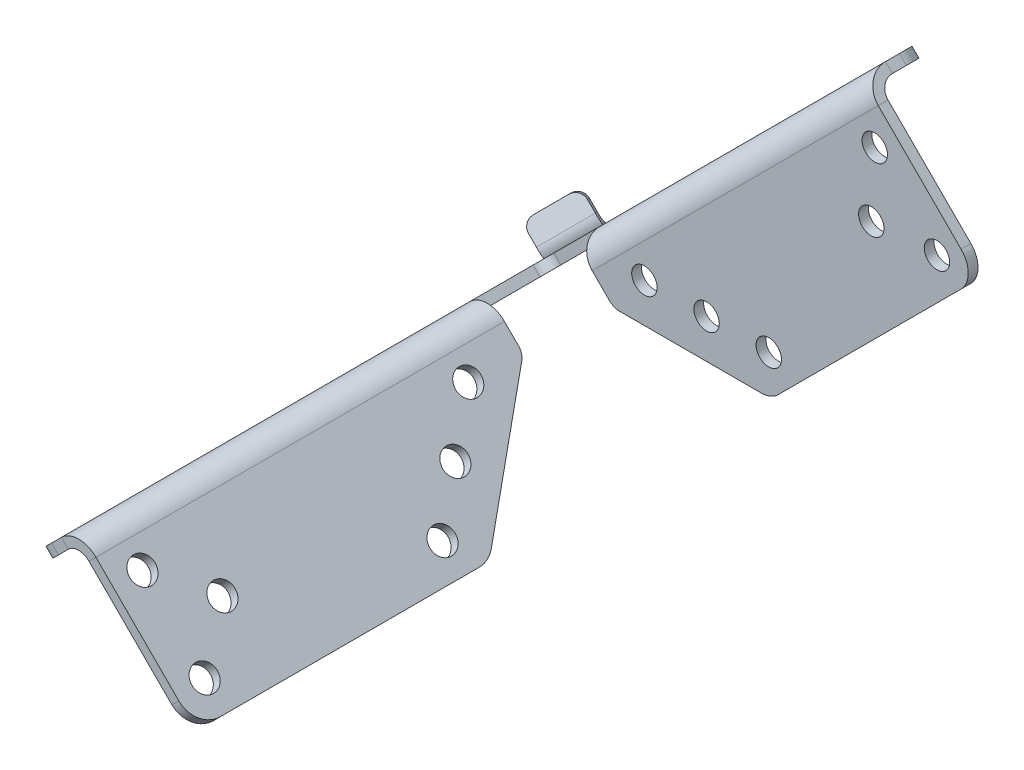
ISO-10303-21;
HEADER;
FILE_DESCRIPTION(('STEP AP214'),'2;1');
FILE_NAME('part.step','',(''),(''),'','','');
FILE_SCHEMA(('AUTOMOTIVE_DESIGN { 1 0 10303 214 1 1 1 1 }'));
ENDSEC;
DATA;
#1=APPLICATION_CONTEXT('core data for automotive mechanical design processes');
#2=APPLICATION_PROTOCOL_DEFINITION('international standard','automotive_design',2000,#1);
#3=PRODUCT_CONTEXT('',#1,'mechanical');
#4=PRODUCT('Part','Part','',(#3));
#5=PRODUCT_RELATED_PRODUCT_CATEGORY('part','',(#4));
#6=PRODUCT_DEFINITION_FORMATION('','',#4);
#7=PRODUCT_DEFINITION_CONTEXT('part definition',#1,'design');
#8=PRODUCT_DEFINITION('design','',#6,#7);
#9=PRODUCT_DEFINITION_SHAPE('','',#8);
#10=(LENGTH_UNIT() NAMED_UNIT(*) SI_UNIT(.MILLI.,.METRE.));
#11=(NAMED_UNIT(*) PLANE_ANGLE_UNIT() SI_UNIT($,.RADIAN.));
#12=(NAMED_UNIT(*) SI_UNIT($,.STERADIAN.) SOLID_ANGLE_UNIT());
#13=UNCERTAINTY_MEASURE_WITH_UNIT(LENGTH_MEASURE(1.E-05),#10,'distance_accuracy_value','');
#14=(GEOMETRIC_REPRESENTATION_CONTEXT(3) GLOBAL_UNCERTAINTY_ASSIGNED_CONTEXT((#13)) GLOBAL_UNIT_ASSIGNED_CONTEXT((#10,
#11,#12)) REPRESENTATION_CONTEXT('',''));
#15=CARTESIAN_POINT('',(0.,0.,0.));
#16=DIRECTION('',(0.,0.,1.));
#17=DIRECTION('',(1.,0.,0.));
#18=AXIS2_PLACEMENT_3D('',#15,#16,#17);
#19=CARTESIAN_POINT('',(-15.649259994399,-29.2257101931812,-23.0603893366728));
#20=DIRECTION('',(0.500001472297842,0.500001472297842,-0.707104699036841));
#21=DIRECTION('',(-0.816494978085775,0.,-0.577352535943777));
#22=AXIS2_PLACEMENT_3D('',#19,#20,#21);
#23=PLANE('',#22);
#24=DIRECTION('',(-0.499998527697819,-0.499998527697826,-0.707108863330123));
#25=VECTOR('',#24,1.);
#26=CARTESIAN_POINT('',(-13.9311359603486,-16.1938776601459,-12.6305336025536));
#27=LINE('',#26,#25);
#28=CARTESIAN_POINT('',(-20.8061157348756,-23.068857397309,-22.3532804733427));
#29=VERTEX_POINT('',#28);
#30=CARTESIAN_POINT('',(-21.3061142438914,-23.5688559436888,-23.0603893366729));
#31=VERTEX_POINT('',#30);
#32=EDGE_CURVE('E415',#29,#31,#27,.T.);
#33=ORIENTED_EDGE('',*,*,#32,.F.);
#34=DIRECTION('',(-0.70710678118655,0.707106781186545,0.));
#35=VECTOR('',#34,1.);
#36=CARTESIAN_POINT('',(-15.1492614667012,-28.7257116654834,-22.3532804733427));
#37=LINE('',#36,#35);
#38=CARTESIAN_POINT('',(-22.2203292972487,-21.6546438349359,-22.3532804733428));
#39=VERTEX_POINT('',#38);
#40=EDGE_CURVE('E751',#29,#39,#37,.T.);
#41=ORIENTED_EDGE('',*,*,#40,.T.);
#42=DIRECTION('',(-0.499998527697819,-0.499998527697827,-0.707108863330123));
#43=VECTOR('',#42,1.);
#44=CARTESIAN_POINT('',(-22.7203278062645,-22.1546423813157,-23.0603893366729));
#45=LINE('',#44,#43);
#46=CARTESIAN_POINT('',(-22.7203278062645,-22.1546423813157,-23.0603893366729));
#47=VERTEX_POINT('',#46);
#48=EDGE_CURVE('E393',#39,#47,#45,.T.);
#49=ORIENTED_EDGE('',*,*,#48,.T.);
#50=DIRECTION('',(-0.70710678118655,0.707106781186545,0.));
#51=VECTOR('',#50,1.);
#52=CARTESIAN_POINT('',(-15.649259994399,-29.2257101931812,-23.0603893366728));
#53=LINE('',#52,#51);
#54=EDGE_CURVE('E408',#31,#47,#53,.T.);
#55=ORIENTED_EDGE('',*,*,#54,.F.);
#56=EDGE_LOOP('',(#33,#41,#49,#55));
#57=FACE_BOUND('',#56,.T.);
#58=ADVANCED_FACE('F61',(#57),#23,.F.);
#59=CARTESIAN_POINT('',(-10.6492452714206,-24.2256954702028,-30.1314363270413));
#60=DIRECTION('',(-0.500001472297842,-0.500001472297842,0.707104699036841));
#61=DIRECTION('',(0.816494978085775,0.,0.577352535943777));
#62=AXIS2_PLACEMENT_3D('',#59,#60,#61);
#63=PLANE('',#62);
#64=DIRECTION('',(0.499998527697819,0.499998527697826,0.707108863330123));
#65=VECTOR('',#64,1.);
#66=CARTESIAN_POINT('',(-17.7203130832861,-17.1546276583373,-30.1314363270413));
#67=LINE('',#66,#65);
#68=CARTESIAN_POINT('',(-17.7203130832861,-17.1546276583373,-30.1314363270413));
#69=VERTEX_POINT('',#68);
#70=CARTESIAN_POINT('',(-17.2203145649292,-16.6546291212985,-29.4243274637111));
#71=VERTEX_POINT('',#70);
#72=EDGE_CURVE('E419',#69,#71,#67,.T.);
#73=ORIENTED_EDGE('',*,*,#72,.T.);
#74=DIRECTION('',(0.70710678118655,-0.707106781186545,0.));
#75=VECTOR('',#74,1.);
#76=CARTESIAN_POINT('',(-10.1492467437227,-23.7256969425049,-29.4243274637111));
#77=LINE('',#76,#75);
#78=CARTESIAN_POINT('',(-15.8061009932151,-18.0688426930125,-29.4243274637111));
#79=VERTEX_POINT('',#78);
#80=EDGE_CURVE('E757',#71,#79,#77,.T.);
#81=ORIENTED_EDGE('',*,*,#80,.T.);
#82=DIRECTION('',(0.499998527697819,0.499998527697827,0.707108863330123));
#83=VECTOR('',#82,1.);
#84=CARTESIAN_POINT('',(-8.93112123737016,-11.1938629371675,-19.701580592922));
#85=LINE('',#84,#83);
#86=CARTESIAN_POINT('',(-16.306099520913,-18.5688412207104,-30.1314363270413));
#87=VERTEX_POINT('',#86);
#88=EDGE_CURVE('E432',#87,#79,#85,.T.);
#89=ORIENTED_EDGE('',*,*,#88,.F.);
#90=DIRECTION('',(-0.70710678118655,0.707106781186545,0.));
#91=VECTOR('',#90,1.);
#92=CARTESIAN_POINT('',(-10.6492452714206,-24.2256954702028,-30.1314363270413));
#93=LINE('',#92,#91);
#94=EDGE_CURVE('E426',#87,#69,#93,.T.);
#95=ORIENTED_EDGE('',*,*,#94,.T.);
#96=EDGE_LOOP('',(#73,#81,#89,#95));
#97=FACE_BOUND('',#96,.T.);
#98=ADVANCED_FACE('F858',(#97),#63,.F.);
#99=CARTESIAN_POINT('',(-11.4311285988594,-13.6938702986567,-16.1660570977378));
#100=DIRECTION('',(-0.70710678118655,0.707106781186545,0.));
#101=DIRECTION('',(0.499999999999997,0.499999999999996,-0.707106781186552));
#102=AXIS2_PLACEMENT_3D('',#99,#100,#101);
#103=PLANE('',#102);
#104=DIRECTION('',(0.707106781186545,0.70710678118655,0.));
#105=VECTOR('',#104,1.);
#106=CARTESIAN_POINT('',(22.8188714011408,20.5561297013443,95.8062913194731));
#107=LINE('',#106,#105);
#108=CARTESIAN_POINT('',(-4.14714925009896,-6.40989094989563,95.8062913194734));
#109=VERTEX_POINT('',#108);
#110=CARTESIAN_POINT('',(-2.12132034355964,-4.3840620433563,95.8062913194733));
#111=VERTEX_POINT('',#110);
#112=EDGE_CURVE('E663',#109,#111,#107,.T.);
#113=ORIENTED_EDGE('',*,*,#112,.F.);
#114=CARTESIAN_POINT('',(-4.14714925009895,-6.40989094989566,90.8062913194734));
#115=DIRECTION('',(-0.70710678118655,0.707106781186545,0.));
#116=DIRECTION('',(-0.707106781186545,-0.70710678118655,0.));
#117=AXIS2_PLACEMENT_3D('',#114,#115,#116);
#118=CIRCLE('',#117,5.);
#119=CARTESIAN_POINT('',(-7.56848406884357,-9.83122576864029,92.066821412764));
#120=VERTEX_POINT('',#119);
#121=EDGE_CURVE('E1075',#109,#120,#118,.F.);
#122=ORIENTED_EDGE('',*,*,#121,.T.);
#123=DIRECTION('',(0.178265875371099,0.178265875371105,0.967699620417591));
#124=VECTOR('',#123,1.);
#125=CARTESIAN_POINT('',(-26.4850018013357,-28.7477435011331,-10.619724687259));
#126=LINE('',#125,#124);
#127=CARTESIAN_POINT('',(-26.4850018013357,-28.7477435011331,-10.619724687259));
#128=VERTEX_POINT('',#127);
#129=EDGE_CURVE('E666',#128,#120,#126,.T.);
#130=ORIENTED_EDGE('',*,*,#129,.F.);
#131=CARTESIAN_POINT('',(-11.4311285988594,-13.6938702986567,-16.1660570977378));
#132=DIRECTION('',(-0.70710678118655,0.707106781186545,0.));
#133=DIRECTION('',(0.499999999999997,0.499999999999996,-0.707106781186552));
#134=AXIS2_PLACEMENT_3D('',#131,#132,#133);
#135=CIRCLE('',#134,22.);
#136=CARTESIAN_POINT('',(-7.50927934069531,-9.77202104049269,-37.4554487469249));
#137=VERTEX_POINT('',#136);
#138=EDGE_CURVE('E586',#137,#128,#135,.T.);
#139=ORIENTED_EDGE('',*,*,#138,.F.);
#140=DIRECTION('',(-0.684266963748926,-0.684266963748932,-0.25210601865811));
#141=VECTOR('',#140,1.);
#142=CARTESIAN_POINT('',(-7.50927934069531,-9.77202104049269,-37.4554487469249));
#143=LINE('',#142,#141);
#144=CARTESIAN_POINT('',(65.101073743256,62.8383320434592,-10.7034528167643));
#145=VERTEX_POINT('',#144);
#146=EDGE_CURVE('E1117',#145,#137,#143,.T.);
#147=ORIENTED_EDGE('',*,*,#146,.F.);
#148=CARTESIAN_POINT('',(64.2097443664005,61.9470026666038,-5.86495471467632));
#149=DIRECTION('',(-0.70710678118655,0.707106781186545,0.));
#150=DIRECTION('',(-0.707106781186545,-0.70710678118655,0.));
#151=AXIS2_PLACEMENT_3D('',#148,#149,#150);
#152=CIRCLE('',#151,5.);
#153=CARTESIAN_POINT('',(67.7452782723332,65.4825365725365,-5.86495471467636));
#154=VERTEX_POINT('',#153);
#155=EDGE_CURVE('E1102',#145,#154,#152,.F.);
#156=ORIENTED_EDGE('',*,*,#155,.T.);
#157=DIRECTION('',(0.,0.,-1.));
#158=VECTOR('',#157,1.);
#159=CARTESIAN_POINT('',(67.7452782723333,65.4825365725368,32.2707574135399));
#160=LINE('',#159,#158);
#161=CARTESIAN_POINT('',(67.7452782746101,65.4825365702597,-3.0000000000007));
#162=VERTEX_POINT('',#161);
#163=EDGE_CURVE('E1130',#162,#154,#160,.T.);
#164=ORIENTED_EDGE('',*,*,#163,.F.);
#165=DIRECTION('',(0.707106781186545,0.70710678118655,0.));
#166=VECTOR('',#165,1.);
#167=CARTESIAN_POINT('',(-11.4311285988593,-13.6938702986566,-2.99999999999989));
#168=LINE('',#167,#166);
#169=CARTESIAN_POINT('',(9.19238815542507,6.92964645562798,-3.0000000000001));
#170=VERTEX_POINT('',#169);
#171=EDGE_CURVE('E647',#170,#162,#168,.T.);
#172=ORIENTED_EDGE('',*,*,#171,.F.);
#173=DIRECTION('',(0.,0.,-1.));
#174=VECTOR('',#173,1.);
#175=CARTESIAN_POINT('',(9.19238815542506,6.9296464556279,-16.166057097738));
#176=LINE('',#175,#174);
#177=CARTESIAN_POINT('',(9.19238815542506,6.92964645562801,-3.81681469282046));
#178=VERTEX_POINT('',#177);
#179=EDGE_CURVE('E482',#170,#178,#176,.T.);
#180=ORIENTED_EDGE('',*,*,#179,.T.);
#181=DIRECTION('',(-0.707106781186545,-0.70710678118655,0.));
#182=VECTOR('',#181,1.);
#183=CARTESIAN_POINT('',(-11.4311285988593,-13.6938702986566,-3.81681469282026));
#184=LINE('',#183,#182);
#185=CARTESIAN_POINT('',(-0.931128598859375,-3.19387029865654,-3.81681469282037));
#186=VERTEX_POINT('',#185);
#187=EDGE_CURVE('E490',#178,#186,#184,.T.);
#188=ORIENTED_EDGE('',*,*,#187,.T.);
#189=CARTESIAN_POINT('',(-0.931128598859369,-3.19387029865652,-1.31681469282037));
#190=DIRECTION('',(0.70710678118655,-0.707106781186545,0.));
#191=DIRECTION('',(0.499999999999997,0.499999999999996,-0.707106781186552));
#192=AXIS2_PLACEMENT_3D('',#189,#190,#191);
#193=CIRCLE('',#192,2.49999999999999);
#194=CARTESIAN_POINT('',(-2.69889555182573,-4.96163725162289,-1.31681469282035));
#195=VERTEX_POINT('',#194);
#196=EDGE_CURVE('E665',#195,#186,#193,.T.);
#197=ORIENTED_EDGE('',*,*,#196,.F.);
#198=DIRECTION('',(0.,0.,1.));
#199=VECTOR('',#198,1.);
#200=CARTESIAN_POINT('',(-2.69889555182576,-4.961637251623,-16.1660570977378));
#201=LINE('',#200,#199);
#202=CARTESIAN_POINT('',(-2.69889555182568,-4.96163725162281,12.1831853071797));
#203=VERTEX_POINT('',#202);
#204=EDGE_CURVE('E487',#195,#203,#201,.T.);
#205=ORIENTED_EDGE('',*,*,#204,.T.);
#206=DIRECTION('',(0.707106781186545,0.70710678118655,0.));
#207=VECTOR('',#206,1.);
#208=CARTESIAN_POINT('',(-11.4311285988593,-13.6938702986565,12.1831853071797));
#209=LINE('',#208,#207);
#210=CARTESIAN_POINT('',(-2.12132034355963,-4.38406204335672,12.1831853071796));
#211=VERTEX_POINT('',#210);
#212=EDGE_CURVE('E470',#203,#211,#209,.T.);
#213=ORIENTED_EDGE('',*,*,#212,.T.);
#214=DIRECTION('',(0.,0.,1.));
#215=VECTOR('',#214,1.);
#216=CARTESIAN_POINT('',(-2.12132034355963,-4.38406204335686,-16.1660570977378));
#217=LINE('',#216,#215);
#218=EDGE_CURVE('E662',#211,#111,#217,.T.);
#219=ORIENTED_EDGE('',*,*,#218,.T.);
#220=EDGE_LOOP('',(#113,#122,#130,#139,#147,#156,#164,#172,#180,#188,#197,#205,#213,#219));
#221=FACE_BOUND('',#220,.T.);
#222=CARTESIAN_POINT('',(6.06887140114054,3.80612970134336,-16.1660570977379));
#223=DIRECTION('',(-0.70710678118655,0.707106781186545,0.));
#224=DIRECTION('',(-0.707106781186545,-0.70710678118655,0.));
#225=AXIS2_PLACEMENT_3D('',#222,#223,#224);
#226=CIRCLE('',#225,2.6);
#227=CARTESIAN_POINT('',(4.23039377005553,1.96765207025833,-16.1660570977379));
#228=VERTEX_POINT('',#227);
#229=EDGE_CURVE('E445',#228,#228,#226,.T.);
#230=ORIENTED_EDGE('',*,*,#229,.T.);
#231=EDGE_LOOP('',(#230));
#232=FACE_BOUND('',#231,.T.);
#233=CARTESIAN_POINT('',(-11.4311285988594,-13.6938702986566,8.58268024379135));
#234=DIRECTION('',(-0.70710678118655,0.707106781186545,0.));
#235=DIRECTION('',(-0.707106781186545,-0.70710678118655,0.));
#236=AXIS2_PLACEMENT_3D('',#233,#234,#235);
#237=CIRCLE('',#236,2.6);
#238=CARTESIAN_POINT('',(-13.2696062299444,-15.5323479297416,8.58268024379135));
#239=VERTEX_POINT('',#238);
#240=EDGE_CURVE('E439',#239,#239,#237,.T.);
#241=ORIENTED_EDGE('',*,*,#240,.T.);
#242=EDGE_LOOP('',(#241));
#243=FACE_BOUND('',#242,.T.);
#244=DIRECTION('',(0.499998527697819,0.499998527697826,0.707108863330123));
#245=VECTOR('',#244,1.);
#246=CARTESIAN_POINT('',(-14.4311374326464,-16.6938791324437,-11.9234289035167));
#247=LINE('',#246,#245);
#248=CARTESIAN_POINT('',(-21.8061157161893,-24.0688574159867,-22.353284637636));
#249=VERTEX_POINT('',#248);
#250=CARTESIAN_POINT('',(-19.2932857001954,-21.5560273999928,-18.7995854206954));
#251=VERTEX_POINT('',#250);
#252=EDGE_CURVE('E411',#249,#251,#247,.T.);
#253=ORIENTED_EDGE('',*,*,#252,.T.);
#254=CARTESIAN_POINT('',(-20.793290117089,-23.0560318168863,-16.6782713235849));
#255=DIRECTION('',(-0.70710678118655,0.707106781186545,0.));
#256=DIRECTION('',(-0.707106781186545,-0.70710678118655,0.));
#257=AXIS2_PLACEMENT_3D('',#254,#255,#256);
#258=CIRCLE('',#257,3.);
#259=CARTESIAN_POINT('',(-18.6735554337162,-20.9362971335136,-16.5622982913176));
#260=VERTEX_POINT('',#259);
#261=EDGE_CURVE('E69',#251,#260,#258,.F.);
#262=ORIENTED_EDGE('',*,*,#261,.T.);
#263=CARTESIAN_POINT('',(-11.4311285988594,-13.6938702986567,-16.1660570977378));
#264=DIRECTION('',(-0.70710678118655,0.707106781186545,0.));
#265=DIRECTION('',(-0.707106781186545,-0.70710678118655,0.));
#266=AXIS2_PLACEMENT_3D('',#263,#264,#265);
#267=CIRCLE('',#266,10.25);
#268=CARTESIAN_POINT('',(-11.7112707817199,-13.9740124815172,-26.4083976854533));
#269=VERTEX_POINT('',#268);
#270=EDGE_CURVE('E451',#260,#269,#267,.T.);
#271=ORIENTED_EDGE('',*,*,#270,.T.);
#272=CARTESIAN_POINT('',(-11.7932636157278,-14.0560053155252,-29.406155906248));
#273=DIRECTION('',(-0.70710678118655,0.707106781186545,0.));
#274=DIRECTION('',(-0.707106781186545,-0.70710678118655,0.));
#275=AXIS2_PLACEMENT_3D('',#272,#273,#274);
#276=CIRCLE('',#275,3.);
#277=CARTESIAN_POINT('',(-13.2932680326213,-15.5560097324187,-27.2848418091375));
#278=VERTEX_POINT('',#277);
#279=EDGE_CURVE('E76',#269,#278,#276,.F.);
#280=ORIENTED_EDGE('',*,*,#279,.T.);
#281=DIRECTION('',(-0.49999852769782,-0.499998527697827,-0.707108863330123));
#282=VECTOR('',#281,1.);
#283=CARTESIAN_POINT('',(-8.43111976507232,-10.6938614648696,-20.4086852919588));
#284=LINE('',#283,#282);
#285=CARTESIAN_POINT('',(-15.8060980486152,-18.0688397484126,-30.8385410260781));
#286=VERTEX_POINT('',#285);
#287=EDGE_CURVE('E428',#278,#286,#284,.T.);
#288=ORIENTED_EDGE('',*,*,#287,.T.);
#289=DIRECTION('',(-0.500001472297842,-0.500001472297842,0.70710469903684));
#290=VECTOR('',#289,1.);
#291=CARTESIAN_POINT('',(-18.8061068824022,-21.0688485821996,-26.5959128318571));
#292=LINE('',#291,#290);
#293=EDGE_CURVE('E433',#286,#87,#292,.T.);
#294=ORIENTED_EDGE('',*,*,#293,.T.);
#295=ORIENTED_EDGE('',*,*,#88,.T.);
#296=DIRECTION('',(-0.500001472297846,-0.500001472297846,0.707104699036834));
#297=VECTOR('',#296,1.);
#298=CARTESIAN_POINT('',(-18.3061083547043,-20.5688500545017,-25.888803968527));
#299=LINE('',#298,#297);
#300=EDGE_CURVE('E754',#79,#29,#299,.T.);
#301=ORIENTED_EDGE('',*,*,#300,.T.);
#302=ORIENTED_EDGE('',*,*,#32,.T.);
#303=DIRECTION('',(-0.500001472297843,-0.500001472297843,0.707104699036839));
#304=VECTOR('',#303,1.);
#305=CARTESIAN_POINT('',(-18.8061068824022,-21.0688485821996,-26.5959128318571));
#306=LINE('',#305,#304);
#307=EDGE_CURVE('E416',#31,#249,#306,.T.);
#308=ORIENTED_EDGE('',*,*,#307,.T.);
#309=EDGE_LOOP('',(#253,#262,#271,#280,#288,#294,#295,#301,#302,#308));
#310=FACE_BOUND('',#309,.T.);
#311=ADVANCED_FACE('F794',(#221,#232,#243,#310),#103,.F.);
#312=CARTESIAN_POINT('',(-2.34534216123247,-1.77965673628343,-1.31681469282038));
#313=DIRECTION('',(0.70710678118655,-0.707106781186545,0.));
#314=DIRECTION('',(-0.499999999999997,-0.499999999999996,0.707106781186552));
#315=AXIS2_PLACEMENT_3D('',#312,#313,#314);
#316=CYLINDRICAL_SURFACE('',#315,2.49999999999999);
#317=ORIENTED_EDGE('',*,*,#196,.T.);
#318=DIRECTION('',(0.70710678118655,-0.707106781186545,0.));
#319=VECTOR('',#318,1.);
#320=CARTESIAN_POINT('',(-2.34534216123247,-1.77965673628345,-3.81681469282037));
#321=LINE('',#320,#319);
#322=CARTESIAN_POINT('',(-2.34534216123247,-1.77965673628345,-3.81681469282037));
#323=VERTEX_POINT('',#322);
#324=EDGE_CURVE('E1163',#186,#323,#321,.F.);
#325=ORIENTED_EDGE('',*,*,#324,.T.);
#326=CARTESIAN_POINT('',(-2.34534216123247,-1.77965673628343,-1.31681469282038));
#327=DIRECTION('',(0.70710678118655,-0.707106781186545,0.));
#328=DIRECTION('',(0.499999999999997,0.499999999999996,-0.707106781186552));
#329=AXIS2_PLACEMENT_3D('',#326,#327,#328);
#330=CIRCLE('',#329,2.49999999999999);
#331=CARTESIAN_POINT('',(-4.11310911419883,-3.5474236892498,-1.31681469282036));
#332=VERTEX_POINT('',#331);
#333=EDGE_CURVE('E668',#332,#323,#330,.T.);
#334=ORIENTED_EDGE('',*,*,#333,.F.);
#335=DIRECTION('',(0.70710678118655,-0.707106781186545,0.));
#336=VECTOR('',#335,1.);
#337=CARTESIAN_POINT('',(-4.11310911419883,-3.5474236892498,-1.31681469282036));
#338=LINE('',#337,#336);
#339=EDGE_CURVE('E1162',#195,#332,#338,.F.);
#340=ORIENTED_EDGE('',*,*,#339,.F.);
#341=EDGE_LOOP('',(#317,#325,#334,#340));
#342=FACE_BOUND('',#341,.T.);
#343=ADVANCED_FACE('F869',(#342),#316,.F.);
#344=CARTESIAN_POINT('',(21.4046578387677,21.9703432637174,95.8062913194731));
#345=DIRECTION('',(0.,0.,-1.));
#346=DIRECTION('',(-0.707106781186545,-0.70710678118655,0.));
#347=AXIS2_PLACEMENT_3D('',#344,#345,#346);
#348=PLANE('',#347);
#349=DIRECTION('',(0.707106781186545,0.70710678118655,0.));
#350=VECTOR('',#349,1.);
#351=CARTESIAN_POINT('',(21.4046578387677,21.9703432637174,95.8062913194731));
#352=LINE('',#351,#350);
#353=CARTESIAN_POINT('',(-5.56136281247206,-4.99567738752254,95.8062913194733));
#354=VERTEX_POINT('',#353);
#355=CARTESIAN_POINT('',(-3.53553390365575,-2.96984848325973,95.8062913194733));
#356=VERTEX_POINT('',#355);
#357=EDGE_CURVE('E667',#354,#356,#352,.T.);
#358=ORIENTED_EDGE('',*,*,#357,.F.);
#359=DIRECTION('',(0.70710678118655,-0.707106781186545,0.));
#360=VECTOR('',#359,1.);
#361=CARTESIAN_POINT('',(-5.56136281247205,-4.99567738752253,95.8062913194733));
#362=LINE('',#361,#360);
#363=EDGE_CURVE('E1100',#354,#109,#362,.T.);
#364=ORIENTED_EDGE('',*,*,#363,.T.);
#365=ORIENTED_EDGE('',*,*,#112,.T.);
#366=DIRECTION('',(-0.70710678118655,0.707106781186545,0.));
#367=VECTOR('',#366,1.);
#368=CARTESIAN_POINT('',(-3.53553390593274,-2.96984848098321,95.8062913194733));
#369=LINE('',#368,#367);
#370=EDGE_CURVE('E659',#111,#356,#369,.T.);
#371=ORIENTED_EDGE('',*,*,#370,.T.);
#372=EDGE_LOOP('',(#358,#364,#365,#371));
#373=FACE_BOUND('',#372,.T.);
#374=ADVANCED_FACE('F704',(#373),#348,.F.);
#375=CARTESIAN_POINT('',(-12.8453421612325,-12.2796567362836,-16.1660570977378));
#376=DIRECTION('',(-0.70710678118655,0.707106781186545,0.));
#377=DIRECTION('',(0.499999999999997,0.499999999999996,-0.707106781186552));
#378=AXIS2_PLACEMENT_3D('',#375,#376,#377);
#379=PLANE('',#378);
#380=CARTESIAN_POINT('',(-12.8453421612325,-12.2796567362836,-16.1660570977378));
#381=DIRECTION('',(-0.70710678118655,0.707106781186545,0.));
#382=DIRECTION('',(-0.707106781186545,-0.70710678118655,0.));
#383=AXIS2_PLACEMENT_3D('',#380,#381,#382);
#384=CIRCLE('',#383,10.25);
#385=CARTESIAN_POINT('',(-20.0877689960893,-19.5220835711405,-16.5622982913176));
#386=VERTEX_POINT('',#385);
#387=CARTESIAN_POINT('',(-13.125484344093,-12.5597989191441,-26.4083976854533));
#388=VERTEX_POINT('',#387);
#389=EDGE_CURVE('E448',#386,#388,#384,.T.);
#390=ORIENTED_EDGE('',*,*,#389,.F.);
#391=CARTESIAN_POINT('',(-22.2075036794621,-21.6418182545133,-16.6782713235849));
#392=DIRECTION('',(-0.70710678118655,0.707106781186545,0.));
#393=DIRECTION('',(-0.707106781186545,-0.70710678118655,0.));
#394=AXIS2_PLACEMENT_3D('',#391,#392,#393);
#395=CIRCLE('',#394,3.);
#396=CARTESIAN_POINT('',(-20.7074992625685,-20.1418138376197,-18.7995854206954));
#397=VERTEX_POINT('',#396);
#398=EDGE_CURVE('E789',#386,#397,#395,.T.);
#399=ORIENTED_EDGE('',*,*,#398,.T.);
#400=DIRECTION('',(0.499998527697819,0.499998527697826,0.707108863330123));
#401=VECTOR('',#400,1.);
#402=CARTESIAN_POINT('',(-23.2203292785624,-22.6546438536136,-22.353284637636));
#403=LINE('',#402,#401);
#404=CARTESIAN_POINT('',(-23.2203292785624,-22.6546438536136,-22.353284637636));
#405=VERTEX_POINT('',#404);
#406=EDGE_CURVE('E406',#405,#397,#403,.T.);
#407=ORIENTED_EDGE('',*,*,#406,.F.);
#408=DIRECTION('',(-0.500001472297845,-0.500001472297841,0.707104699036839));
#409=VECTOR('',#408,1.);
#410=CARTESIAN_POINT('',(-22.7203278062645,-22.1546423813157,-23.0603893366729));
#411=LINE('',#410,#409);
#412=EDGE_CURVE('E396',#47,#405,#411,.T.);
#413=ORIENTED_EDGE('',*,*,#412,.F.);
#414=ORIENTED_EDGE('',*,*,#48,.F.);
#415=DIRECTION('',(-0.500001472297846,-0.500001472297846,0.707104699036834));
#416=VECTOR('',#415,1.);
#417=CARTESIAN_POINT('',(-19.7203219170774,-19.1546364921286,-25.888803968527));
#418=LINE('',#417,#416);
#419=EDGE_CURVE('E392',#71,#39,#418,.T.);
#420=ORIENTED_EDGE('',*,*,#419,.F.);
#421=ORIENTED_EDGE('',*,*,#72,.F.);
#422=DIRECTION('',(-0.500001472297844,-0.500001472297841,0.70710469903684));
#423=VECTOR('',#422,1.);
#424=CARTESIAN_POINT('',(-17.7203130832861,-17.1546276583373,-30.1314363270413));
#425=LINE('',#424,#423);
#426=CARTESIAN_POINT('',(-17.2203116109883,-16.6546261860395,-30.8385410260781));
#427=VERTEX_POINT('',#426);
#428=EDGE_CURVE('E422',#427,#69,#425,.T.);
#429=ORIENTED_EDGE('',*,*,#428,.F.);
#430=DIRECTION('',(-0.49999852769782,-0.499998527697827,-0.707108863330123));
#431=VECTOR('',#430,1.);
#432=CARTESIAN_POINT('',(-17.2203116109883,-16.6546261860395,-30.8385410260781));
#433=LINE('',#432,#431);
#434=CARTESIAN_POINT('',(-14.7074815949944,-14.1417961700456,-27.2848418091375));
#435=VERTEX_POINT('',#434);
#436=EDGE_CURVE('E420',#435,#427,#433,.T.);
#437=ORIENTED_EDGE('',*,*,#436,.F.);
#438=CARTESIAN_POINT('',(-13.2074771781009,-12.6417917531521,-29.406155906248));
#439=DIRECTION('',(-0.70710678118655,0.707106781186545,0.));
#440=DIRECTION('',(-0.707106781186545,-0.70710678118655,0.));
#441=AXIS2_PLACEMENT_3D('',#438,#439,#440);
#442=CIRCLE('',#441,3.);
#443=EDGE_CURVE('E787',#435,#388,#442,.T.);
#444=ORIENTED_EDGE('',*,*,#443,.T.);
#445=EDGE_LOOP('',(#390,#399,#407,#413,#414,#420,#421,#429,#437,#444));
#446=FACE_BOUND('',#445,.T.);
#447=CARTESIAN_POINT('',(-12.8453421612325,-12.2796567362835,8.58268024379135));
#448=DIRECTION('',(-0.70710678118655,0.707106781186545,0.));
#449=DIRECTION('',(0.707106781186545,0.70710678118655,0.));
#450=AXIS2_PLACEMENT_3D('',#447,#448,#449);
#451=CIRCLE('',#450,2.6);
#452=CARTESIAN_POINT('',(-11.0068645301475,-10.4411791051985,8.58268024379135));
#453=VERTEX_POINT('',#452);
#454=EDGE_CURVE('E436',#453,#453,#451,.T.);
#455=ORIENTED_EDGE('',*,*,#454,.F.);
#456=EDGE_LOOP('',(#455));
#457=FACE_BOUND('',#456,.T.);
#458=CARTESIAN_POINT('',(4.65465783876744,5.22034326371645,-16.1660570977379));
#459=DIRECTION('',(-0.70710678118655,0.707106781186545,0.));
#460=DIRECTION('',(-0.707106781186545,-0.70710678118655,0.));
#461=AXIS2_PLACEMENT_3D('',#458,#459,#460);
#462=CIRCLE('',#461,2.6);
#463=CARTESIAN_POINT('',(2.81618020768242,3.38186563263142,-16.1660570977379));
#464=VERTEX_POINT('',#463);
#465=EDGE_CURVE('E442',#464,#464,#462,.T.);
#466=ORIENTED_EDGE('',*,*,#465,.F.);
#467=EDGE_LOOP('',(#466));
#468=FACE_BOUND('',#467,.T.);
#469=DIRECTION('',(0.178265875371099,0.178265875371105,0.967699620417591));
#470=VECTOR('',#469,1.);
#471=CARTESIAN_POINT('',(-27.8992153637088,-27.33352993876,-10.619724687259));
#472=LINE('',#471,#470);
#473=CARTESIAN_POINT('',(-27.8992153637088,-27.33352993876,-10.619724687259));
#474=VERTEX_POINT('',#473);
#475=CARTESIAN_POINT('',(-8.98269763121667,-8.4170122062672,92.066821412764));
#476=VERTEX_POINT('',#475);
#477=EDGE_CURVE('E669',#474,#476,#472,.T.);
#478=ORIENTED_EDGE('',*,*,#477,.T.);
#479=CARTESIAN_POINT('',(-5.56136281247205,-4.99567738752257,90.8062913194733));
#480=DIRECTION('',(-0.70710678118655,0.707106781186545,0.));
#481=DIRECTION('',(-0.707106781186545,-0.70710678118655,0.));
#482=AXIS2_PLACEMENT_3D('',#479,#480,#481);
#483=CIRCLE('',#482,5.);
#484=EDGE_CURVE('E1070',#476,#354,#483,.T.);
#485=ORIENTED_EDGE('',*,*,#484,.T.);
#486=ORIENTED_EDGE('',*,*,#357,.T.);
#487=DIRECTION('',(0.,0.,1.));
#488=VECTOR('',#487,1.);
#489=CARTESIAN_POINT('',(-3.53553390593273,-2.96984848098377,-16.1660570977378));
#490=LINE('',#489,#488);
#491=CARTESIAN_POINT('',(-3.53553390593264,-2.96984848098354,12.1831853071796));
#492=VERTEX_POINT('',#491);
#493=EDGE_CURVE('E644',#492,#356,#490,.T.);
#494=ORIENTED_EDGE('',*,*,#493,.F.);
#495=DIRECTION('',(0.707106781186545,0.70710678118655,0.));
#496=VECTOR('',#495,1.);
#497=CARTESIAN_POINT('',(-4.11310911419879,-3.5474236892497,12.1831853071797));
#498=LINE('',#497,#496);
#499=CARTESIAN_POINT('',(-4.11310911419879,-3.5474236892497,12.1831853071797));
#500=VERTEX_POINT('',#499);
#501=EDGE_CURVE('E456',#500,#492,#498,.T.);
#502=ORIENTED_EDGE('',*,*,#501,.F.);
#503=DIRECTION('',(0.,0.,1.));
#504=VECTOR('',#503,1.);
#505=CARTESIAN_POINT('',(-4.11310911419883,-3.5474236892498,-1.31681469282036));
#506=LINE('',#505,#504);
#507=EDGE_CURVE('E453',#332,#500,#506,.T.);
#508=ORIENTED_EDGE('',*,*,#507,.F.);
#509=ORIENTED_EDGE('',*,*,#333,.T.);
#510=DIRECTION('',(-0.707106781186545,-0.70710678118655,0.));
#511=VECTOR('',#510,1.);
#512=CARTESIAN_POINT('',(-2.34534216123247,-1.77965673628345,-3.81681469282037));
#513=LINE('',#512,#511);
#514=CARTESIAN_POINT('',(7.77817459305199,8.34386001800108,-3.81681469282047));
#515=VERTEX_POINT('',#514);
#516=EDGE_CURVE('E461',#515,#323,#513,.T.);
#517=ORIENTED_EDGE('',*,*,#516,.F.);
#518=DIRECTION('',(0.,0.,-1.));
#519=VECTOR('',#518,1.);
#520=CARTESIAN_POINT('',(7.77817459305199,8.34386001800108,-3.81681469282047));
#521=LINE('',#520,#519);
#522=CARTESIAN_POINT('',(7.77817459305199,8.34386001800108,-3.00000000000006));
#523=VERTEX_POINT('',#522);
#524=EDGE_CURVE('E458',#523,#515,#521,.T.);
#525=ORIENTED_EDGE('',*,*,#524,.F.);
#526=DIRECTION('',(0.707106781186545,0.70710678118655,0.));
#527=VECTOR('',#526,1.);
#528=CARTESIAN_POINT('',(-12.8453421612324,-12.2796567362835,-2.9999999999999));
#529=LINE('',#528,#527);
#530=CARTESIAN_POINT('',(66.3310647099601,66.8967501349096,-3.0000000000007));
#531=VERTEX_POINT('',#530);
#532=EDGE_CURVE('E651',#523,#531,#529,.T.);
#533=ORIENTED_EDGE('',*,*,#532,.T.);
#534=DIRECTION('',(0.,0.,-1.));
#535=VECTOR('',#534,1.);
#536=CARTESIAN_POINT('',(66.3310647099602,66.8967501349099,32.2707574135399));
#537=LINE('',#536,#535);
#538=CARTESIAN_POINT('',(66.3310647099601,66.8967501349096,-5.86495471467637));
#539=VERTEX_POINT('',#538);
#540=EDGE_CURVE('E1123',#531,#539,#537,.T.);
#541=ORIENTED_EDGE('',*,*,#540,.T.);
#542=CARTESIAN_POINT('',(62.7955308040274,63.3612162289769,-5.86495471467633));
#543=DIRECTION('',(-0.70710678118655,0.707106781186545,0.));
#544=DIRECTION('',(-0.707106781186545,-0.70710678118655,0.));
#545=AXIS2_PLACEMENT_3D('',#542,#543,#544);
#546=CIRCLE('',#545,5.);
#547=CARTESIAN_POINT('',(63.6868601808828,64.2525456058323,-10.7034528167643));
#548=VERTEX_POINT('',#547);
#549=EDGE_CURVE('E1067',#539,#548,#546,.T.);
#550=ORIENTED_EDGE('',*,*,#549,.T.);
#551=DIRECTION('',(-0.684266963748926,-0.684266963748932,-0.25210601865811));
#552=VECTOR('',#551,1.);
#553=CARTESIAN_POINT('',(-8.92349290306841,-8.3578074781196,-37.4554487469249));
#554=LINE('',#553,#552);
#555=CARTESIAN_POINT('',(-8.92349290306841,-8.3578074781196,-37.4554487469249));
#556=VERTEX_POINT('',#555);
#557=EDGE_CURVE('E1124',#548,#556,#554,.T.);
#558=ORIENTED_EDGE('',*,*,#557,.T.);
#559=CARTESIAN_POINT('',(-12.8453421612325,-12.2796567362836,-16.1660570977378));
#560=DIRECTION('',(-0.70710678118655,0.707106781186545,0.));
#561=DIRECTION('',(0.499999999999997,0.499999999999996,-0.707106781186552));
#562=AXIS2_PLACEMENT_3D('',#559,#560,#561);
#563=CIRCLE('',#562,22.);
#564=EDGE_CURVE('E1115',#556,#474,#563,.T.);
#565=ORIENTED_EDGE('',*,*,#564,.T.);
#566=EDGE_LOOP('',(#478,#485,#486,#494,#502,#508,#509,#517,#525,#533,#541,#550,#558,#565));
#567=FACE_BOUND('',#566,.T.);
#568=ADVANCED_FACE('F804',(#446,#457,#468,#567),#379,.T.);
#569=CARTESIAN_POINT('',(-12.8453421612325,-12.2796567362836,-16.1660570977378));
#570=DIRECTION('',(0.70710678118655,-0.707106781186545,0.));
#571=DIRECTION('',(-0.499999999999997,-0.499999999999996,0.707106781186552));
#572=AXIS2_PLACEMENT_3D('',#569,#570,#571);
#573=CYLINDRICAL_SURFACE('',#572,22.);
#574=ORIENTED_EDGE('',*,*,#138,.T.);
#575=DIRECTION('',(0.70710678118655,-0.707106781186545,0.));
#576=VECTOR('',#575,1.);
#577=CARTESIAN_POINT('',(-27.8992153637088,-27.33352993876,-10.619724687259));
#578=LINE('',#577,#576);
#579=EDGE_CURVE('E1109',#474,#128,#578,.T.);
#580=ORIENTED_EDGE('',*,*,#579,.F.);
#581=ORIENTED_EDGE('',*,*,#564,.F.);
#582=DIRECTION('',(0.70710678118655,-0.707106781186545,0.));
#583=VECTOR('',#582,1.);
#584=CARTESIAN_POINT('',(-8.92349290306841,-8.3578074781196,-37.4554487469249));
#585=LINE('',#584,#583);
#586=EDGE_CURVE('E1126',#556,#137,#585,.T.);
#587=ORIENTED_EDGE('',*,*,#586,.T.);
#588=EDGE_LOOP('',(#574,#580,#581,#587));
#589=FACE_BOUND('',#588,.T.);
#590=ADVANCED_FACE('F1028',(#589),#573,.T.);
#591=CARTESIAN_POINT('',(-27.8992153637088,-27.33352993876,-10.619724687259));
#592=DIRECTION('',(0.684266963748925,0.684266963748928,-0.252106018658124));
#593=DIRECTION('',(-0.178265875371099,-0.178265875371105,-0.967699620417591));
#594=AXIS2_PLACEMENT_3D('',#591,#592,#593);
#595=PLANE('',#594);
#596=ORIENTED_EDGE('',*,*,#129,.T.);
#597=DIRECTION('',(0.70710678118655,-0.707106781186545,0.));
#598=VECTOR('',#597,1.);
#599=CARTESIAN_POINT('',(-8.98269763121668,-8.4170122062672,92.066821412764));
#600=LINE('',#599,#598);
#601=EDGE_CURVE('E1071',#120,#476,#600,.F.);
#602=ORIENTED_EDGE('',*,*,#601,.T.);
#603=ORIENTED_EDGE('',*,*,#477,.F.);
#604=ORIENTED_EDGE('',*,*,#579,.T.);
#605=EDGE_LOOP('',(#596,#602,#603,#604));
#606=FACE_BOUND('',#605,.T.);
#607=ADVANCED_FACE('F1025',(#606),#595,.F.);
#608=CARTESIAN_POINT('',(66.3310647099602,66.8967501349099,32.2707574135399));
#609=DIRECTION('',(-0.707106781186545,-0.70710678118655,0.));
#610=DIRECTION('',(0.,0.,1.));
#611=AXIS2_PLACEMENT_3D('',#608,#609,#610);
#612=PLANE('',#611);
#613=ORIENTED_EDGE('',*,*,#163,.T.);
#614=DIRECTION('',(0.70710678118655,-0.707106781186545,0.));
#615=VECTOR('',#614,1.);
#616=CARTESIAN_POINT('',(66.3310647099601,66.8967501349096,-5.86495471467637));
#617=LINE('',#616,#615);
#618=EDGE_CURVE('E748',#154,#539,#617,.F.);
#619=ORIENTED_EDGE('',*,*,#618,.T.);
#620=ORIENTED_EDGE('',*,*,#540,.F.);
#621=DIRECTION('',(-0.70710678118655,0.707106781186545,0.));
#622=VECTOR('',#621,1.);
#623=CARTESIAN_POINT('',(66.3310647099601,66.8967501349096,-3.00000000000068));
#624=LINE('',#623,#622);
#625=EDGE_CURVE('E650',#162,#531,#624,.T.);
#626=ORIENTED_EDGE('',*,*,#625,.F.);
#627=EDGE_LOOP('',(#613,#619,#620,#626));
#628=FACE_BOUND('',#627,.T.);
#629=ADVANCED_FACE('F1022',(#628),#612,.F.);
#630=CARTESIAN_POINT('',(-8.92349290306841,-8.3578074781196,-37.4554487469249));
#631=DIRECTION('',(-0.178265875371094,-0.17826587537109,0.967699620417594));
#632=DIRECTION('',(0.684266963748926,0.684266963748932,0.25210601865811));
#633=AXIS2_PLACEMENT_3D('',#630,#631,#632);
#634=PLANE('',#633);
#635=ORIENTED_EDGE('',*,*,#557,.F.);
#636=DIRECTION('',(0.70710678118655,-0.707106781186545,0.));
#637=VECTOR('',#636,1.);
#638=CARTESIAN_POINT('',(63.6868601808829,64.2525456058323,-10.7034528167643));
#639=LINE('',#638,#637);
#640=EDGE_CURVE('E745',#548,#145,#639,.T.);
#641=ORIENTED_EDGE('',*,*,#640,.T.);
#642=ORIENTED_EDGE('',*,*,#146,.T.);
#643=ORIENTED_EDGE('',*,*,#586,.F.);
#644=EDGE_LOOP('',(#635,#641,#642,#643));
#645=FACE_BOUND('',#644,.T.);
#646=ADVANCED_FACE('F981',(#645),#634,.F.);
#647=CARTESIAN_POINT('',(69.1507039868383,55.5918294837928,-8.00000000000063));
#648=DIRECTION('',(0.,0.,1.));
#649=DIRECTION('',(0.,1.,0.));
#650=AXIS2_PLACEMENT_3D('',#647,#648,#649);
#651=CYLINDRICAL_SURFACE('',#650,2.6);
#652=CARTESIAN_POINT('',(69.1507039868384,55.5918294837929,1.99999999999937));
#653=DIRECTION('',(0.,0.,1.));
#654=DIRECTION('',(0.,-1.,0.));
#655=AXIS2_PLACEMENT_3D('',#652,#653,#654);
#656=CIRCLE('',#655,2.6);
#657=CARTESIAN_POINT('',(69.1507039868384,52.9918294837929,1.99999999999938));
#658=VERTEX_POINT('',#657);
#659=EDGE_CURVE('E633',#658,#658,#656,.T.);
#660=ORIENTED_EDGE('',*,*,#659,.T.);
#661=EDGE_LOOP('',(#660));
#662=FACE_BOUND('',#661,.T.);
#663=CARTESIAN_POINT('',(69.1507039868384,55.5918294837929,-6.30812268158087E-13));
#664=DIRECTION('',(0.,0.,1.));
#665=DIRECTION('',(0.,1.,0.));
#666=AXIS2_PLACEMENT_3D('',#663,#664,#665);
#667=CIRCLE('',#666,2.6);
#668=CARTESIAN_POINT('',(69.1507039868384,58.1918294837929,-6.4402822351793E-13));
#669=VERTEX_POINT('',#668);
#670=EDGE_CURVE('E605',#669,#669,#667,.T.);
#671=ORIENTED_EDGE('',*,*,#670,.F.);
#672=EDGE_LOOP('',(#671));
#673=FACE_BOUND('',#672,.T.);
#674=ADVANCED_FACE('F977',(#662,#673),#651,.F.);
#675=CARTESIAN_POINT('',(47.4522191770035,8.43750055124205,-8.00000000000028));
#676=DIRECTION('',(0.,0.,1.));
#677=DIRECTION('',(0.,1.,0.));
#678=AXIS2_PLACEMENT_3D('',#675,#676,#677);
#679=CYLINDRICAL_SURFACE('',#678,2.6);
#680=CARTESIAN_POINT('',(47.4522191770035,8.4375005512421,1.99999999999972));
#681=DIRECTION('',(0.,0.,1.));
#682=DIRECTION('',(0.,-1.,0.));
#683=AXIS2_PLACEMENT_3D('',#680,#681,#682);
#684=CIRCLE('',#683,2.6);
#685=CARTESIAN_POINT('',(47.4522191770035,5.83750055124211,1.99999999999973));
#686=VERTEX_POINT('',#685);
#687=EDGE_CURVE('E630',#686,#686,#684,.T.);
#688=ORIENTED_EDGE('',*,*,#687,.T.);
#689=EDGE_LOOP('',(#688));
#690=FACE_BOUND('',#689,.T.);
#691=CARTESIAN_POINT('',(47.4522191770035,8.43750055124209,-2.83983320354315E-13));
#692=DIRECTION('',(0.,0.,1.));
#693=DIRECTION('',(0.,1.,0.));
#694=AXIS2_PLACEMENT_3D('',#691,#692,#693);
#695=CIRCLE('',#694,2.6);
#696=CARTESIAN_POINT('',(47.4522191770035,11.0375005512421,-2.97199275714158E-13));
#697=VERTEX_POINT('',#696);
#698=EDGE_CURVE('E602',#697,#697,#695,.T.);
#699=ORIENTED_EDGE('',*,*,#698,.F.);
#700=EDGE_LOOP('',(#699));
#701=FACE_BOUND('',#700,.T.);
#702=ADVANCED_FACE('F980',(#690,#701),#679,.F.);
#703=CARTESIAN_POINT('',(21.9963750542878,8.43750055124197,-8.00000000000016));
#704=DIRECTION('',(0.,0.,1.));
#705=DIRECTION('',(0.,1.,0.));
#706=AXIS2_PLACEMENT_3D('',#703,#704,#705);
#707=CYLINDRICAL_SURFACE('',#706,2.6);
#708=CARTESIAN_POINT('',(21.9963750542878,8.43750055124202,1.99999999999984));
#709=DIRECTION('',(0.,0.,1.));
#710=DIRECTION('',(0.,-1.,0.));
#711=AXIS2_PLACEMENT_3D('',#708,#709,#710);
#712=CIRCLE('',#711,2.6);
#713=CARTESIAN_POINT('',(21.9963750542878,5.83750055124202,1.99999999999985));
#714=VERTEX_POINT('',#713);
#715=EDGE_CURVE('E627',#714,#714,#712,.T.);
#716=ORIENTED_EDGE('',*,*,#715,.T.);
#717=EDGE_LOOP('',(#716));
#718=FACE_BOUND('',#717,.T.);
#719=CARTESIAN_POINT('',(21.9963750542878,8.43750055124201,-1.58289919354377E-13));
#720=DIRECTION('',(0.,0.,1.));
#721=DIRECTION('',(0.,1.,0.));
#722=AXIS2_PLACEMENT_3D('',#719,#720,#721);
#723=CIRCLE('',#722,2.6);
#724=CARTESIAN_POINT('',(21.9963750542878,11.037500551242,-1.7150587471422E-13));
#725=VERTEX_POINT('',#724);
#726=EDGE_CURVE('E599',#725,#725,#723,.T.);
#727=ORIENTED_EDGE('',*,*,#726,.F.);
#728=EDGE_LOOP('',(#727));
#729=FACE_BOUND('',#728,.T.);
#730=ADVANCED_FACE('F985',(#718,#729),#707,.F.);
#731=CARTESIAN_POINT('',(34.7242971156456,8.43750055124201,-8.00000000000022));
#732=DIRECTION('',(0.,0.,1.));
#733=DIRECTION('',(0.,1.,0.));
#734=AXIS2_PLACEMENT_3D('',#731,#732,#733);
#735=CYLINDRICAL_SURFACE('',#734,2.6);
#736=CARTESIAN_POINT('',(34.7242971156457,8.43750055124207,1.99999999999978));
#737=DIRECTION('',(0.,0.,1.));
#738=DIRECTION('',(0.,-1.,0.));
#739=AXIS2_PLACEMENT_3D('',#736,#737,#738);
#740=CIRCLE('',#739,2.6);
#741=CARTESIAN_POINT('',(34.7242971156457,5.83750055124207,1.99999999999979));
#742=VERTEX_POINT('',#741);
#743=EDGE_CURVE('E624',#742,#742,#740,.T.);
#744=ORIENTED_EDGE('',*,*,#743,.T.);
#745=EDGE_LOOP('',(#744));
#746=FACE_BOUND('',#745,.T.);
#747=CARTESIAN_POINT('',(34.7242971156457,8.43750055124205,-2.21136619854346E-13));
#748=DIRECTION('',(0.,0.,1.));
#749=DIRECTION('',(0.,1.,0.));
#750=AXIS2_PLACEMENT_3D('',#747,#748,#749);
#751=CIRCLE('',#750,2.6);
#752=CARTESIAN_POINT('',(34.7242971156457,11.0375005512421,-2.34352575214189E-13));
#753=VERTEX_POINT('',#752);
#754=EDGE_CURVE('E596',#753,#753,#751,.T.);
#755=ORIENTED_EDGE('',*,*,#754,.F.);
#756=EDGE_LOOP('',(#755));
#757=FACE_BOUND('',#756,.T.);
#758=ADVANCED_FACE('F989',(#746,#757),#735,.F.);
#759=CARTESIAN_POINT('',(68.4435972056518,42.1568006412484,-8.00000000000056));
#760=DIRECTION('',(0.,0.,1.));
#761=DIRECTION('',(0.,1.,0.));
#762=AXIS2_PLACEMENT_3D('',#759,#760,#761);
#763=CYLINDRICAL_SURFACE('',#762,2.6);
#764=CARTESIAN_POINT('',(68.4435972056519,42.1568006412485,1.99999999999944));
#765=DIRECTION('',(0.,0.,1.));
#766=DIRECTION('',(0.,-1.,0.));
#767=AXIS2_PLACEMENT_3D('',#764,#765,#766);
#768=CIRCLE('',#767,2.6);
#769=CARTESIAN_POINT('',(68.4435972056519,39.5568006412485,1.99999999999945));
#770=VERTEX_POINT('',#769);
#771=EDGE_CURVE('E621',#770,#770,#768,.T.);
#772=ORIENTED_EDGE('',*,*,#771,.T.);
#773=EDGE_LOOP('',(#772));
#774=FACE_BOUND('',#773,.T.);
#775=CARTESIAN_POINT('',(68.4435972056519,42.1568006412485,-5.59029730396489E-13));
#776=DIRECTION('',(0.,0.,1.));
#777=DIRECTION('',(0.,1.,0.));
#778=AXIS2_PLACEMENT_3D('',#775,#776,#777);
#779=CIRCLE('',#778,2.6);
#780=CARTESIAN_POINT('',(68.4435972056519,44.7568006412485,-5.72245685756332E-13));
#781=VERTEX_POINT('',#780);
#782=EDGE_CURVE('E593',#781,#781,#779,.T.);
#783=ORIENTED_EDGE('',*,*,#782,.F.);
#784=EDGE_LOOP('',(#783));
#785=FACE_BOUND('',#784,.T.);
#786=ADVANCED_FACE('F993',(#774,#785),#763,.F.);
#787=CARTESIAN_POINT('',(81.8786260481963,42.863907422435,-8.00000000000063));
#788=DIRECTION('',(0.,0.,1.));
#789=DIRECTION('',(0.,1.,0.));
#790=AXIS2_PLACEMENT_3D('',#787,#788,#789);
#791=CYLINDRICAL_SURFACE('',#790,2.6);
#792=CARTESIAN_POINT('',(81.8786260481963,42.8639074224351,1.99999999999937));
#793=DIRECTION('',(0.,0.,1.));
#794=DIRECTION('',(0.,-1.,0.));
#795=AXIS2_PLACEMENT_3D('',#792,#793,#794);
#796=CIRCLE('',#795,2.6);
#797=CARTESIAN_POINT('',(81.8786260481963,40.2639074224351,1.99999999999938));
#798=VERTEX_POINT('',#797);
#799=EDGE_CURVE('E618',#798,#798,#796,.T.);
#800=ORIENTED_EDGE('',*,*,#799,.T.);
#801=EDGE_LOOP('',(#800));
#802=FACE_BOUND('',#801,.T.);
#803=CARTESIAN_POINT('',(81.8786260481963,42.8639074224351,-6.28962180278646E-13));
#804=DIRECTION('',(0.,0.,1.));
#805=DIRECTION('',(0.,1.,0.));
#806=AXIS2_PLACEMENT_3D('',#803,#804,#805);
#807=CIRCLE('',#806,2.6);
#808=CARTESIAN_POINT('',(81.8786260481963,45.4639074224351,-6.42178135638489E-13));
#809=VERTEX_POINT('',#808);
#810=EDGE_CURVE('E590',#809,#809,#807,.T.);
#811=ORIENTED_EDGE('',*,*,#810,.F.);
#812=EDGE_LOOP('',(#811));
#813=FACE_BOUND('',#812,.T.);
#814=ADVANCED_FACE('F997',(#802,#813),#791,.F.);
#815=CARTESIAN_POINT('',(47.9375005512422,0.437500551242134,1.99999999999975));
#816=DIRECTION('',(-0.707106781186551,0.707106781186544,0.));
#817=DIRECTION('',(-0.707106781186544,-0.707106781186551,0.));
#818=AXIS2_PLACEMENT_3D('',#815,#816,#817);
#819=PLANE('',#818);
#820=DIRECTION('',(0.707106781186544,0.707106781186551,0.));
#821=VECTOR('',#820,1.);
#822=CARTESIAN_POINT('',(47.9375005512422,0.437500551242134,1.99999999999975));
#823=LINE('',#822,#821);
#824=CARTESIAN_POINT('',(49.4019666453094,1.90196664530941,1.99999999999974));
#825=VERTEX_POINT('',#824);
#826=CARTESIAN_POINT('',(86.8283735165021,39.3283735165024,1.99999999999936));
#827=VERTEX_POINT('',#826);
#828=EDGE_CURVE('E611',#825,#827,#823,.T.);
#829=ORIENTED_EDGE('',*,*,#828,.F.);
#830=DIRECTION('',(0.,0.,-1.));
#831=VECTOR('',#830,1.);
#832=CARTESIAN_POINT('',(49.4019666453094,1.90196664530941,1.99999999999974));
#833=LINE('',#832,#831);
#834=CARTESIAN_POINT('',(49.4019666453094,1.9019666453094,-2.6039008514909E-13));
#835=VERTEX_POINT('',#834);
#836=EDGE_CURVE('E729',#825,#835,#833,.T.);
#837=ORIENTED_EDGE('',*,*,#836,.T.);
#838=DIRECTION('',(0.707106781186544,0.707106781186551,0.));
#839=VECTOR('',#838,1.);
#840=CARTESIAN_POINT('',(47.9375005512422,0.437500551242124,-2.45715017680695E-13));
#841=LINE('',#840,#839);
#842=CARTESIAN_POINT('',(86.8283735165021,39.3283735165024,-6.3543123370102E-13));
#843=VERTEX_POINT('',#842);
#844=EDGE_CURVE('E615',#835,#843,#841,.T.);
#845=ORIENTED_EDGE('',*,*,#844,.T.);
#846=DIRECTION('',(0.,0.,-1.));
#847=VECTOR('',#846,1.);
#848=CARTESIAN_POINT('',(86.8283735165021,39.3283735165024,1.99999999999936));
#849=LINE('',#848,#847);
#850=EDGE_CURVE('E725',#843,#827,#849,.F.);
#851=ORIENTED_EDGE('',*,*,#850,.T.);
#852=EDGE_LOOP('',(#829,#837,#845,#851));
#853=FACE_BOUND('',#852,.T.);
#854=ADVANCED_FACE('F1001',(#853),#819,.F.);
#855=CARTESIAN_POINT('',(-23.0624994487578,-2.06249944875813,2.00000000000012));
#856=DIRECTION('',(0.,0.,1.));
#857=DIRECTION('',(0.,1.,0.));
#858=AXIS2_PLACEMENT_3D('',#855,#856,#857);
#859=PLANE('',#858);
#860=DIRECTION('',(1.,0.,0.));
#861=VECTOR('',#860,1.);
#862=CARTESIAN_POINT('',(-2.06249944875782,0.437500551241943,2.));
#863=LINE('',#862,#861);
#864=CARTESIAN_POINT('',(16.9271747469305,0.437500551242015,1.99999999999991));
#865=VERTEX_POINT('',#864);
#866=CARTESIAN_POINT('',(45.8664327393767,0.437500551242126,1.99999999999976));
#867=VERTEX_POINT('',#866);
#868=EDGE_CURVE('E614',#865,#867,#863,.T.);
#869=ORIENTED_EDGE('',*,*,#868,.T.);
#870=CARTESIAN_POINT('',(45.8664327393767,5.43750055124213,1.99999999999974));
#871=DIRECTION('',(0.,0.,1.));
#872=DIRECTION('',(0.,-1.,0.));
#873=AXIS2_PLACEMENT_3D('',#870,#871,#872);
#874=CIRCLE('',#873,5.);
#875=EDGE_CURVE('E740',#867,#825,#874,.T.);
#876=ORIENTED_EDGE('',*,*,#875,.T.);
#877=ORIENTED_EDGE('',*,*,#828,.T.);
#878=CARTESIAN_POINT('',(83.2928396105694,42.8639074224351,1.99999999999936));
#879=DIRECTION('',(0.,0.,1.));
#880=DIRECTION('',(0.,-1.,0.));
#881=AXIS2_PLACEMENT_3D('',#878,#879,#880);
#882=CIRCLE('',#881,5.);
#883=CARTESIAN_POINT('',(86.8283735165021,46.3994413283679,1.99999999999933));
#884=VERTEX_POINT('',#883);
#885=EDGE_CURVE('E738',#827,#884,#882,.T.);
#886=ORIENTED_EDGE('',*,*,#885,.T.);
#887=DIRECTION('',(-0.70710678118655,0.707106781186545,0.));
#888=VECTOR('',#887,1.);
#889=CARTESIAN_POINT('',(90.3639074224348,42.8639074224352,1.99999999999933));
#890=LINE('',#889,#888);
#891=CARTESIAN_POINT('',(69.866598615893,63.361216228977,1.99999999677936));
#892=VERTEX_POINT('',#891);
#893=EDGE_CURVE('E609',#884,#892,#890,.T.);
#894=ORIENTED_EDGE('',*,*,#893,.T.);
#895=DIRECTION('',(0.707106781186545,0.70710678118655,0.));
#896=VECTOR('',#895,1.);
#897=CARTESIAN_POINT('',(-9.30980825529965,-15.8151906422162,2.00000000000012));
#898=LINE('',#897,#896);
#899=CARTESIAN_POINT('',(11.3137084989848,4.80832611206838,1.99999999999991));
#900=VERTEX_POINT('',#899);
#901=EDGE_CURVE('E580',#900,#892,#898,.T.);
#902=ORIENTED_EDGE('',*,*,#901,.F.);
#903=DIRECTION('',(-0.70710678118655,0.707106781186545,0.));
#904=VECTOR('',#903,1.);
#905=CARTESIAN_POINT('',(-2.43898269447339,18.5610173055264,1.99999999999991));
#906=LINE('',#905,#904);
#907=CARTESIAN_POINT('',(14.8058544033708,1.31618020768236,1.99999999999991));
#908=VERTEX_POINT('',#907);
#909=EDGE_CURVE('E480',#908,#900,#906,.T.);
#910=ORIENTED_EDGE('',*,*,#909,.F.);
#911=CARTESIAN_POINT('',(16.9271747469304,3.43750055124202,1.99999999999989));
#912=DIRECTION('',(0.,0.,1.));
#913=DIRECTION('',(0.,-1.,0.));
#914=AXIS2_PLACEMENT_3D('',#911,#912,#913);
#915=CIRCLE('',#914,3.);
#916=EDGE_CURVE('E1095',#908,#865,#915,.T.);
#917=ORIENTED_EDGE('',*,*,#916,.T.);
#918=EDGE_LOOP('',(#869,#876,#877,#886,#894,#902,#910,#917));
#919=FACE_BOUND('',#918,.T.);
#920=ORIENTED_EDGE('',*,*,#799,.F.);
#921=EDGE_LOOP('',(#920));
#922=FACE_BOUND('',#921,.T.);
#923=ORIENTED_EDGE('',*,*,#771,.F.);
#924=EDGE_LOOP('',(#923));
#925=FACE_BOUND('',#924,.T.);
#926=ORIENTED_EDGE('',*,*,#743,.F.);
#927=EDGE_LOOP('',(#926));
#928=FACE_BOUND('',#927,.T.);
#929=ORIENTED_EDGE('',*,*,#715,.F.);
#930=EDGE_LOOP('',(#929));
#931=FACE_BOUND('',#930,.T.);
#932=ORIENTED_EDGE('',*,*,#687,.F.);
#933=EDGE_LOOP('',(#932));
#934=FACE_BOUND('',#933,.T.);
#935=ORIENTED_EDGE('',*,*,#659,.F.);
#936=EDGE_LOOP('',(#935));
#937=FACE_BOUND('',#936,.T.);
#938=ADVANCED_FACE('F1005',(#919,#922,#925,#928,#931,#934,#937),#859,.T.);
#939=CARTESIAN_POINT('',(-2.06249944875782,0.437500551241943,2.));
#940=DIRECTION('',(0.,1.,0.));
#941=DIRECTION('',(-1.,0.,0.));
#942=AXIS2_PLACEMENT_3D('',#939,#940,#941);
#943=PLANE('',#942);
#944=DIRECTION('',(1.,0.,0.));
#945=VECTOR('',#944,1.);
#946=CARTESIAN_POINT('',(-2.06249944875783,0.437500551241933,0.));
#947=LINE('',#946,#945);
#948=CARTESIAN_POINT('',(16.9271747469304,0.437500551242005,0.));
#949=VERTEX_POINT('',#948);
#950=CARTESIAN_POINT('',(45.8664327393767,0.437500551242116,-2.35488699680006E-13));
#951=VERTEX_POINT('',#950);
#952=EDGE_CURVE('E608',#949,#951,#947,.T.);
#953=ORIENTED_EDGE('',*,*,#952,.T.);
#954=DIRECTION('',(0.,0.,-1.));
#955=VECTOR('',#954,1.);
#956=CARTESIAN_POINT('',(45.8664327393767,0.437500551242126,1.99999999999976));
#957=LINE('',#956,#955);
#958=EDGE_CURVE('E736',#951,#867,#957,.F.);
#959=ORIENTED_EDGE('',*,*,#958,.T.);
#960=ORIENTED_EDGE('',*,*,#868,.F.);
#961=DIRECTION('',(0.,0.,-1.));
#962=VECTOR('',#961,1.);
#963=CARTESIAN_POINT('',(16.9271747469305,0.437500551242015,1.99999999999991));
#964=LINE('',#963,#962);
#965=EDGE_CURVE('E1168',#865,#949,#964,.T.);
#966=ORIENTED_EDGE('',*,*,#965,.T.);
#967=EDGE_LOOP('',(#953,#959,#960,#966));
#968=FACE_BOUND('',#967,.T.);
#969=ADVANCED_FACE('F1009',(#968),#943,.F.);
#970=CARTESIAN_POINT('',(-23.0624994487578,-2.06249944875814,1.17569553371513E-13));
#971=DIRECTION('',(0.,0.,1.));
#972=DIRECTION('',(0.,1.,0.));
#973=AXIS2_PLACEMENT_3D('',#970,#971,#972);
#974=PLANE('',#973);
#975=ORIENTED_EDGE('',*,*,#670,.T.);
#976=EDGE_LOOP('',(#975));
#977=FACE_BOUND('',#976,.T.);
#978=ORIENTED_EDGE('',*,*,#698,.T.);
#979=EDGE_LOOP('',(#978));
#980=FACE_BOUND('',#979,.T.);
#981=ORIENTED_EDGE('',*,*,#726,.T.);
#982=EDGE_LOOP('',(#981));
#983=FACE_BOUND('',#982,.T.);
#984=ORIENTED_EDGE('',*,*,#754,.T.);
#985=EDGE_LOOP('',(#984));
#986=FACE_BOUND('',#985,.T.);
#987=ORIENTED_EDGE('',*,*,#782,.T.);
#988=EDGE_LOOP('',(#987));
#989=FACE_BOUND('',#988,.T.);
#990=ORIENTED_EDGE('',*,*,#810,.T.);
#991=EDGE_LOOP('',(#990));
#992=FACE_BOUND('',#991,.T.);
#993=ORIENTED_EDGE('',*,*,#844,.F.);
#994=CARTESIAN_POINT('',(45.8664327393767,5.43750055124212,-2.61075883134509E-13));
#995=DIRECTION('',(0.,0.,1.));
#996=DIRECTION('',(0.,-1.,0.));
#997=AXIS2_PLACEMENT_3D('',#994,#995,#996);
#998=CIRCLE('',#997,5.);
#999=EDGE_CURVE('E734',#835,#951,#998,.F.);
#1000=ORIENTED_EDGE('',*,*,#999,.T.);
#1001=ORIENTED_EDGE('',*,*,#952,.F.);
#1002=CARTESIAN_POINT('',(16.9271747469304,3.43750055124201,-1.07552855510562E-13));
#1003=DIRECTION('',(0.,0.,1.));
#1004=DIRECTION('',(0.,-1.,0.));
#1005=AXIS2_PLACEMENT_3D('',#1002,#1003,#1004);
#1006=CIRCLE('',#1005,3.);
#1007=CARTESIAN_POINT('',(14.8058544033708,1.31618020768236,0.));
#1008=VERTEX_POINT('',#1007);
#1009=EDGE_CURVE('E1159',#949,#1008,#1006,.F.);
#1010=ORIENTED_EDGE('',*,*,#1009,.T.);
#1011=DIRECTION('',(-0.70710678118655,0.707106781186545,0.));
#1012=VECTOR('',#1011,1.);
#1013=CARTESIAN_POINT('',(-2.43898269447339,18.5610173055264,0.));
#1014=LINE('',#1013,#1012);
#1015=CARTESIAN_POINT('',(11.3137084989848,4.80832611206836,0.));
#1016=VERTEX_POINT('',#1015);
#1017=EDGE_CURVE('E478',#1008,#1016,#1014,.T.);
#1018=ORIENTED_EDGE('',*,*,#1017,.T.);
#1019=DIRECTION('',(0.707106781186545,0.70710678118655,0.));
#1020=VECTOR('',#1019,1.);
#1021=CARTESIAN_POINT('',(-9.30980825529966,-15.8151906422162,1.19568598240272E-13));
#1022=LINE('',#1021,#1020);
#1023=CARTESIAN_POINT('',(69.866598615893,63.361216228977,-3.22064153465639E-09));
#1024=VERTEX_POINT('',#1023);
#1025=EDGE_CURVE('E589',#1016,#1024,#1022,.T.);
#1026=ORIENTED_EDGE('',*,*,#1025,.T.);
#1027=DIRECTION('',(-0.70710678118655,0.707106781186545,0.));
#1028=VECTOR('',#1027,1.);
#1029=CARTESIAN_POINT('',(90.3639074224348,42.8639074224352,-6.70859980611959E-13));
#1030=LINE('',#1029,#1028);
#1031=CARTESIAN_POINT('',(86.8283735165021,46.3994413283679,-6.71373893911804E-13));
#1032=VERTEX_POINT('',#1031);
#1033=EDGE_CURVE('E587',#1032,#1024,#1030,.T.);
#1034=ORIENTED_EDGE('',*,*,#1033,.F.);
#1035=CARTESIAN_POINT('',(83.2928396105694,42.8639074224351,-6.36209834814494E-13));
#1036=DIRECTION('',(0.,0.,1.));
#1037=DIRECTION('',(0.,-1.,0.));
#1038=AXIS2_PLACEMENT_3D('',#1035,#1036,#1037);
#1039=CIRCLE('',#1038,5.);
#1040=EDGE_CURVE('E732',#1032,#843,#1039,.F.);
#1041=ORIENTED_EDGE('',*,*,#1040,.T.);
#1042=EDGE_LOOP('',(#993,#1000,#1001,#1010,#1018,#1026,#1034,#1041));
#1043=FACE_BOUND('',#1042,.T.);
#1044=ADVANCED_FACE('F1013',(#977,#980,#983,#986,#989,#992,#1043),#974,.F.);
#1045=CARTESIAN_POINT('',(90.3639074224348,42.8639074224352,1.99999999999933));
#1046=DIRECTION('',(-0.707106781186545,-0.70710678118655,0.));
#1047=DIRECTION('',(0.70710678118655,-0.707106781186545,0.));
#1048=AXIS2_PLACEMENT_3D('',#1045,#1046,#1047);
#1049=PLANE('',#1048);
#1050=ORIENTED_EDGE('',*,*,#893,.F.);
#1051=DIRECTION('',(0.,0.,-1.));
#1052=VECTOR('',#1051,1.);
#1053=CARTESIAN_POINT('',(86.8283735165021,46.3994413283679,1.99999999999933));
#1054=LINE('',#1053,#1052);
#1055=EDGE_CURVE('E742',#884,#1032,#1054,.T.);
#1056=ORIENTED_EDGE('',*,*,#1055,.T.);
#1057=ORIENTED_EDGE('',*,*,#1033,.T.);
#1058=DIRECTION('',(0.,0.,1.));
#1059=VECTOR('',#1058,1.);
#1060=CARTESIAN_POINT('',(69.8665986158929,63.3612162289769,1.99999999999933));
#1061=LINE('',#1060,#1059);
#1062=EDGE_CURVE('E583',#1024,#892,#1061,.T.);
#1063=ORIENTED_EDGE('',*,*,#1062,.T.);
#1064=EDGE_LOOP('',(#1050,#1056,#1057,#1063));
#1065=FACE_BOUND('',#1064,.T.);
#1066=ADVANCED_FACE('F970',(#1065),#1049,.F.);
#1067=CARTESIAN_POINT('',(69.8665986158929,63.3612162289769,-2.99999999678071));
#1068=DIRECTION('',(0.707106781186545,0.70710678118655,0.));
#1069=DIRECTION('',(-0.70710678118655,0.707106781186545,0.));
#1070=AXIS2_PLACEMENT_3D('',#1067,#1068,#1069);
#1071=PLANE('',#1070);
#1072=CARTESIAN_POINT('',(69.866598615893,63.3612162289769,-3.00000000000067));
#1073=DIRECTION('',(-0.707106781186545,-0.70710678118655,0.));
#1074=DIRECTION('',(0.70710678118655,-0.707106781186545,0.));
#1075=AXIS2_PLACEMENT_3D('',#1072,#1073,#1074);
#1076=CIRCLE('',#1075,2.99999999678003);
#1077=EDGE_CURVE('E561',#1024,#162,#1076,.T.);
#1078=ORIENTED_EDGE('',*,*,#1077,.T.);
#1079=ORIENTED_EDGE('',*,*,#625,.T.);
#1080=CARTESIAN_POINT('',(69.8665986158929,63.3612162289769,-2.99999999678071));
#1081=DIRECTION('',(-0.707106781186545,-0.70710678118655,0.));
#1082=DIRECTION('',(0.70710678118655,-0.707106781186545,0.));
#1083=AXIS2_PLACEMENT_3D('',#1080,#1081,#1082);
#1084=CIRCLE('',#1083,4.99999999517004);
#1085=EDGE_CURVE('E577',#892,#531,#1084,.T.);
#1086=ORIENTED_EDGE('',*,*,#1085,.F.);
#1087=ORIENTED_EDGE('',*,*,#1062,.F.);
#1088=EDGE_LOOP('',(#1078,#1079,#1086,#1087));
#1089=FACE_BOUND('',#1088,.T.);
#1090=ADVANCED_FACE('F968',(#1089),#1071,.T.);
#1091=CARTESIAN_POINT('',(108.042590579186,101.53720819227,-3.00000000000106));
#1092=DIRECTION('',(-0.707106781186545,-0.70710678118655,0.));
#1093=DIRECTION('',(0.70710678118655,-0.707106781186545,0.));
#1094=AXIS2_PLACEMENT_3D('',#1091,#1092,#1093);
#1095=CYLINDRICAL_SURFACE('',#1094,4.99999999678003);
#1096=CARTESIAN_POINT('',(11.3137084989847,4.80832611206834,-3.00000000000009));
#1097=DIRECTION('',(0.707106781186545,0.70710678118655,0.));
#1098=DIRECTION('',(-0.70710678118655,0.707106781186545,0.));
#1099=AXIS2_PLACEMENT_3D('',#1096,#1097,#1098);
#1100=CIRCLE('',#1099,4.99999999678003);
#1101=EDGE_CURVE('E485',#900,#523,#1100,.F.);
#1102=ORIENTED_EDGE('',*,*,#1101,.F.);
#1103=ORIENTED_EDGE('',*,*,#901,.T.);
#1104=ORIENTED_EDGE('',*,*,#1085,.T.);
#1105=ORIENTED_EDGE('',*,*,#532,.F.);
#1106=EDGE_LOOP('',(#1102,#1103,#1104,#1105));
#1107=FACE_BOUND('',#1106,.T.);
#1108=ADVANCED_FACE('F965',(#1107),#1095,.T.);
#1109=CARTESIAN_POINT('',(108.042590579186,101.53720819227,-3.00000000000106));
#1110=DIRECTION('',(-0.707106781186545,-0.70710678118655,0.));
#1111=DIRECTION('',(0.70710678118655,-0.707106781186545,0.));
#1112=AXIS2_PLACEMENT_3D('',#1109,#1110,#1111);
#1113=CYLINDRICAL_SURFACE('',#1112,2.99999999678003);
#1114=ORIENTED_EDGE('',*,*,#1025,.F.);
#1115=CARTESIAN_POINT('',(11.3137084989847,4.80832611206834,-3.00000000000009));
#1116=DIRECTION('',(0.707106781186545,0.70710678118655,0.));
#1117=DIRECTION('',(-0.70710678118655,0.707106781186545,0.));
#1118=AXIS2_PLACEMENT_3D('',#1115,#1116,#1117);
#1119=CIRCLE('',#1118,2.99999999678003);
#1120=EDGE_CURVE('E652',#1016,#170,#1119,.F.);
#1121=ORIENTED_EDGE('',*,*,#1120,.T.);
#1122=ORIENTED_EDGE('',*,*,#171,.T.);
#1123=ORIENTED_EDGE('',*,*,#1077,.F.);
#1124=EDGE_LOOP('',(#1114,#1121,#1122,#1123));
#1125=FACE_BOUND('',#1124,.T.);
#1126=ADVANCED_FACE('F931',(#1125),#1113,.F.);
#1127=CARTESIAN_POINT('',(24.0328427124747,-23.4671572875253,35.8062913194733));
#1128=DIRECTION('',(-0.707106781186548,0.707106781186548,0.));
#1129=DIRECTION('',(0.,0.,1.));
#1130=AXIS2_PLACEMENT_3D('',#1127,#1128,#1129);
#1131=PLANE('',#1130);
#1132=DIRECTION('',(0.,0.,-1.));
#1133=VECTOR('',#1132,1.);
#1134=CARTESIAN_POINT('',(24.0328427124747,-23.4671572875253,35.8062913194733));
#1135=LINE('',#1134,#1133);
#1136=CARTESIAN_POINT('',(24.0328427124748,-23.4671572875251,90.8062913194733));
#1137=VERTEX_POINT('',#1136);
#1138=CARTESIAN_POINT('',(24.0328427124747,-23.4671572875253,37.8773591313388));
#1139=VERTEX_POINT('',#1138);
#1140=EDGE_CURVE('E522',#1137,#1139,#1135,.T.);
#1141=ORIENTED_EDGE('',*,*,#1140,.F.);
#1142=DIRECTION('',(-0.707106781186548,-0.707106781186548,0.));
#1143=VECTOR('',#1142,1.);
#1144=CARTESIAN_POINT('',(24.0328427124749,-23.4671572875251,90.8062913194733));
#1145=LINE('',#1144,#1143);
#1146=CARTESIAN_POINT('',(22.6186291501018,-24.8813708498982,90.8062913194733));
#1147=VERTEX_POINT('',#1146);
#1148=EDGE_CURVE('E562',#1137,#1147,#1145,.T.);
#1149=ORIENTED_EDGE('',*,*,#1148,.T.);
#1150=DIRECTION('',(0.,0.,-1.));
#1151=VECTOR('',#1150,1.);
#1152=CARTESIAN_POINT('',(22.6186291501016,-24.8813708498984,35.8062913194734));
#1153=LINE('',#1152,#1151);
#1154=CARTESIAN_POINT('',(22.6186291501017,-24.8813708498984,37.8773591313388));
#1155=VERTEX_POINT('',#1154);
#1156=EDGE_CURVE('E548',#1147,#1155,#1153,.T.);
#1157=ORIENTED_EDGE('',*,*,#1156,.T.);
#1158=DIRECTION('',(-0.707106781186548,-0.707106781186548,0.));
#1159=VECTOR('',#1158,1.);
#1160=CARTESIAN_POINT('',(24.0328427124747,-23.4671572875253,37.8773591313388));
#1161=LINE('',#1160,#1159);
#1162=EDGE_CURVE('E1073',#1155,#1139,#1161,.F.);
#1163=ORIENTED_EDGE('',*,*,#1162,.T.);
#1164=EDGE_LOOP('',(#1141,#1149,#1157,#1163));
#1165=FACE_BOUND('',#1164,.T.);
#1166=ADVANCED_FACE('F927',(#1165),#1131,.F.);
#1167=CARTESIAN_POINT('',(12.71913421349,-26.2955844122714,41.1199998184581));
#1168=DIRECTION('',(0.707106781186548,0.707106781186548,0.));
#1169=DIRECTION('',(0.499999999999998,-0.500000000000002,-0.707106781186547));
#1170=AXIS2_PLACEMENT_3D('',#1167,#1168,#1169);
#1171=CYLINDRICAL_SURFACE('',#1170,2.6);
#1172=CARTESIAN_POINT('',(19.7902020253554,-19.2245166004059,41.1199998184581));
#1173=DIRECTION('',(0.707106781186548,0.707106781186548,0.));
#1174=DIRECTION('',(0.499999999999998,-0.500000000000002,-0.707106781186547));
#1175=AXIS2_PLACEMENT_3D('',#1172,#1173,#1174);
#1176=CIRCLE('',#1175,2.6);
#1177=CARTESIAN_POINT('',(21.0902020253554,-20.5245166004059,39.281522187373));
#1178=VERTEX_POINT('',#1177);
#1179=EDGE_CURVE('E545',#1178,#1178,#1176,.T.);
#1180=ORIENTED_EDGE('',*,*,#1179,.T.);
#1181=EDGE_LOOP('',(#1180));
#1182=FACE_BOUND('',#1181,.T.);
#1183=CARTESIAN_POINT('',(18.3759884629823,-20.638730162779,41.1199998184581));
#1184=DIRECTION('',(0.707106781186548,0.707106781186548,0.));
#1185=DIRECTION('',(0.499999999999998,-0.500000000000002,-0.707106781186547));
#1186=AXIS2_PLACEMENT_3D('',#1183,#1184,#1185);
#1187=CIRCLE('',#1186,2.6);
#1188=CARTESIAN_POINT('',(19.6759884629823,-21.938730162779,39.281522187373));
#1189=VERTEX_POINT('',#1188);
#1190=EDGE_CURVE('E516',#1189,#1189,#1187,.T.);
#1191=ORIENTED_EDGE('',*,*,#1190,.F.);
#1192=EDGE_LOOP('',(#1191));
#1193=FACE_BOUND('',#1192,.T.);
#1194=ADVANCED_FACE('F930',(#1182,#1193),#1171,.F.);
#1195=CARTESIAN_POINT('',(-0.00878784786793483,-13.5676623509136,23.1199998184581));
#1196=DIRECTION('',(0.707106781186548,0.707106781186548,0.));
#1197=DIRECTION('',(0.499999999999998,-0.500000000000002,-0.707106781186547));
#1198=AXIS2_PLACEMENT_3D('',#1195,#1196,#1197);
#1199=CYLINDRICAL_SURFACE('',#1198,2.6);
#1200=CARTESIAN_POINT('',(7.06227996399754,-6.49659453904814,23.1199998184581));
#1201=DIRECTION('',(0.707106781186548,0.707106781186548,0.));
#1202=DIRECTION('',(0.499999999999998,-0.500000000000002,-0.707106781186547));
#1203=AXIS2_PLACEMENT_3D('',#1200,#1201,#1202);
#1204=CIRCLE('',#1203,2.6);
#1205=CARTESIAN_POINT('',(8.36227996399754,-7.79659453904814,21.281522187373));
#1206=VERTEX_POINT('',#1205);
#1207=EDGE_CURVE('E542',#1206,#1206,#1204,.T.);
#1208=ORIENTED_EDGE('',*,*,#1207,.T.);
#1209=EDGE_LOOP('',(#1208));
#1210=FACE_BOUND('',#1209,.T.);
#1211=CARTESIAN_POINT('',(5.64806640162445,-7.91080810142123,23.1199998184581));
#1212=DIRECTION('',(0.707106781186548,0.707106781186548,0.));
#1213=DIRECTION('',(0.499999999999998,-0.500000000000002,-0.707106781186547));
#1214=AXIS2_PLACEMENT_3D('',#1211,#1212,#1213);
#1215=CIRCLE('',#1214,2.6);
#1216=CARTESIAN_POINT('',(6.94806640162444,-9.21080810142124,21.2815221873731));
#1217=VERTEX_POINT('',#1216);
#1218=EDGE_CURVE('E513',#1217,#1217,#1215,.T.);
#1219=ORIENTED_EDGE('',*,*,#1218,.F.);
#1220=EDGE_LOOP('',(#1219));
#1221=FACE_BOUND('',#1220,.T.);
#1222=ADVANCED_FACE('F935',(#1210,#1221),#1199,.F.);
#1223=CARTESIAN_POINT('',(6.35517318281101,-19.9316233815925,32.1199998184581));
#1224=DIRECTION('',(0.707106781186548,0.707106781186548,0.));
#1225=DIRECTION('',(0.499999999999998,-0.500000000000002,-0.707106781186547));
#1226=AXIS2_PLACEMENT_3D('',#1223,#1224,#1225);
#1227=CYLINDRICAL_SURFACE('',#1226,2.6);
#1228=CARTESIAN_POINT('',(13.4262409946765,-12.860555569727,32.1199998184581));
#1229=DIRECTION('',(0.707106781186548,0.707106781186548,0.));
#1230=DIRECTION('',(0.499999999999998,-0.500000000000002,-0.707106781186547));
#1231=AXIS2_PLACEMENT_3D('',#1228,#1229,#1230);
#1232=CIRCLE('',#1231,2.6);
#1233=CARTESIAN_POINT('',(14.7262409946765,-14.160555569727,30.281522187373));
#1234=VERTEX_POINT('',#1233);
#1235=EDGE_CURVE('E539',#1234,#1234,#1232,.T.);
#1236=ORIENTED_EDGE('',*,*,#1235,.T.);
#1237=EDGE_LOOP('',(#1236));
#1238=FACE_BOUND('',#1237,.T.);
#1239=CARTESIAN_POINT('',(12.0120274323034,-14.2747691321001,32.1199998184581));
#1240=DIRECTION('',(0.707106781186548,0.707106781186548,0.));
#1241=DIRECTION('',(0.499999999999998,-0.500000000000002,-0.707106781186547));
#1242=AXIS2_PLACEMENT_3D('',#1239,#1240,#1241);
#1243=CIRCLE('',#1242,2.6);
#1244=CARTESIAN_POINT('',(13.3120274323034,-15.5747691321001,30.281522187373));
#1245=VERTEX_POINT('',#1244);
#1246=EDGE_CURVE('E510',#1245,#1245,#1243,.T.);
#1247=ORIENTED_EDGE('',*,*,#1246,.F.);
#1248=EDGE_LOOP('',(#1247));
#1249=FACE_BOUND('',#1248,.T.);
#1250=ADVANCED_FACE('F939',(#1238,#1249),#1227,.F.);
#1251=CARTESIAN_POINT('',(6.35517318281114,-19.9316233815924,79.8062913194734));
#1252=DIRECTION('',(0.707106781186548,0.707106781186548,0.));
#1253=DIRECTION('',(0.499999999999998,-0.500000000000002,-0.707106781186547));
#1254=AXIS2_PLACEMENT_3D('',#1251,#1252,#1253);
#1255=CYLINDRICAL_SURFACE('',#1254,2.6);
#1256=CARTESIAN_POINT('',(13.4262409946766,-12.8605555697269,79.8062913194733));
#1257=DIRECTION('',(0.707106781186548,0.707106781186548,0.));
#1258=DIRECTION('',(0.499999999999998,-0.500000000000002,-0.707106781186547));
#1259=AXIS2_PLACEMENT_3D('',#1256,#1257,#1258);
#1260=CIRCLE('',#1259,2.6);
#1261=CARTESIAN_POINT('',(14.7262409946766,-14.1605555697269,77.9678136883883));
#1262=VERTEX_POINT('',#1261);
#1263=EDGE_CURVE('E536',#1262,#1262,#1260,.T.);
#1264=ORIENTED_EDGE('',*,*,#1263,.T.);
#1265=EDGE_LOOP('',(#1264));
#1266=FACE_BOUND('',#1265,.T.);
#1267=CARTESIAN_POINT('',(12.0120274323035,-14.2747691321,79.8062913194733));
#1268=DIRECTION('',(0.707106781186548,0.707106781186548,0.));
#1269=DIRECTION('',(0.499999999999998,-0.500000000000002,-0.707106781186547));
#1270=AXIS2_PLACEMENT_3D('',#1267,#1268,#1269);
#1271=CIRCLE('',#1270,2.6);
#1272=CARTESIAN_POINT('',(13.3120274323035,-15.5747691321,77.9678136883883));
#1273=VERTEX_POINT('',#1272);
#1274=EDGE_CURVE('E507',#1273,#1273,#1271,.T.);
#1275=ORIENTED_EDGE('',*,*,#1274,.F.);
#1276=EDGE_LOOP('',(#1275));
#1277=FACE_BOUND('',#1276,.T.);
#1278=ADVANCED_FACE('F943',(#1266,#1277),#1255,.F.);
#1279=CARTESIAN_POINT('',(12.7191342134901,-26.2955844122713,89.8062913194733));
#1280=DIRECTION('',(0.707106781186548,0.707106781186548,0.));
#1281=DIRECTION('',(0.499999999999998,-0.500000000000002,-0.707106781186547));
#1282=AXIS2_PLACEMENT_3D('',#1279,#1280,#1281);
#1283=CYLINDRICAL_SURFACE('',#1282,2.6);
#1284=CARTESIAN_POINT('',(19.7902020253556,-19.2245166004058,89.8062913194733));
#1285=DIRECTION('',(0.707106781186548,0.707106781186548,0.));
#1286=DIRECTION('',(0.499999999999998,-0.500000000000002,-0.707106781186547));
#1287=AXIS2_PLACEMENT_3D('',#1284,#1285,#1286);
#1288=CIRCLE('',#1287,2.6);
#1289=CARTESIAN_POINT('',(21.0902020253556,-20.5245166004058,87.9678136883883));
#1290=VERTEX_POINT('',#1289);
#1291=EDGE_CURVE('E533',#1290,#1290,#1288,.T.);
#1292=ORIENTED_EDGE('',*,*,#1291,.T.);
#1293=EDGE_LOOP('',(#1292));
#1294=FACE_BOUND('',#1293,.T.);
#1295=CARTESIAN_POINT('',(18.3759884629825,-20.6387301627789,89.8062913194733));
#1296=DIRECTION('',(0.707106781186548,0.707106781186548,0.));
#1297=DIRECTION('',(0.499999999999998,-0.500000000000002,-0.707106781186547));
#1298=AXIS2_PLACEMENT_3D('',#1295,#1296,#1297);
#1299=CIRCLE('',#1298,2.6);
#1300=CARTESIAN_POINT('',(19.6759884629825,-21.9387301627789,87.9678136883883));
#1301=VERTEX_POINT('',#1300);
#1302=EDGE_CURVE('E504',#1301,#1301,#1299,.T.);
#1303=ORIENTED_EDGE('',*,*,#1302,.F.);
#1304=EDGE_LOOP('',(#1303));
#1305=FACE_BOUND('',#1304,.T.);
#1306=ADVANCED_FACE('F947',(#1294,#1305),#1283,.F.);
#1307=CARTESIAN_POINT('',(-0.00878784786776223,-13.5676623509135,89.8062913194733));
#1308=DIRECTION('',(0.707106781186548,0.707106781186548,0.));
#1309=DIRECTION('',(0.499999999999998,-0.500000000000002,-0.707106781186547));
#1310=AXIS2_PLACEMENT_3D('',#1307,#1308,#1309);
#1311=CYLINDRICAL_SURFACE('',#1310,2.6);
#1312=CARTESIAN_POINT('',(7.06227996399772,-6.49659453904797,89.8062913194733));
#1313=DIRECTION('',(0.707106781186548,0.707106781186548,0.));
#1314=DIRECTION('',(0.499999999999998,-0.500000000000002,-0.707106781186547));
#1315=AXIS2_PLACEMENT_3D('',#1312,#1313,#1314);
#1316=CIRCLE('',#1315,2.6);
#1317=CARTESIAN_POINT('',(8.36227996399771,-7.79659453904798,87.9678136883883));
#1318=VERTEX_POINT('',#1317);
#1319=EDGE_CURVE('E529',#1318,#1318,#1316,.T.);
#1320=ORIENTED_EDGE('',*,*,#1319,.T.);
#1321=EDGE_LOOP('',(#1320));
#1322=FACE_BOUND('',#1321,.T.);
#1323=CARTESIAN_POINT('',(5.64806640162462,-7.91080810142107,89.8062913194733));
#1324=DIRECTION('',(0.707106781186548,0.707106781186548,0.));
#1325=DIRECTION('',(0.499999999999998,-0.500000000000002,-0.707106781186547));
#1326=AXIS2_PLACEMENT_3D('',#1323,#1324,#1325);
#1327=CIRCLE('',#1326,2.6);
#1328=CARTESIAN_POINT('',(6.94806640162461,-9.21080810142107,87.9678136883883));
#1329=VERTEX_POINT('',#1328);
#1330=EDGE_CURVE('E500',#1329,#1329,#1327,.T.);
#1331=ORIENTED_EDGE('',*,*,#1330,.F.);
#1332=EDGE_LOOP('',(#1331));
#1333=FACE_BOUND('',#1332,.T.);
#1334=ADVANCED_FACE('F951',(#1322,#1333),#1311,.F.);
#1335=CARTESIAN_POINT('',(-10.2171572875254,10.7828427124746,-16.1660570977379));
#1336=DIRECTION('',(0.707106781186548,0.707106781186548,0.));
#1337=DIRECTION('',(0.499999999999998,-0.500000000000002,-0.707106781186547));
#1338=AXIS2_PLACEMENT_3D('',#1335,#1336,#1337);
#1339=PLANE('',#1338);
#1340=DIRECTION('',(0.707106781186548,-0.707106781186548,0.));
#1341=VECTOR('',#1340,1.);
#1342=CARTESIAN_POINT('',(24.0328427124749,-23.4671572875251,95.8062913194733));
#1343=LINE('',#1342,#1341);
#1344=CARTESIAN_POINT('',(3.53553390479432,-2.96984848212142,95.8062913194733));
#1345=VERTEX_POINT('',#1344);
#1346=CARTESIAN_POINT('',(20.4973088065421,-19.9316233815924,95.8062913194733));
#1347=VERTEX_POINT('',#1346);
#1348=EDGE_CURVE('E525',#1345,#1347,#1343,.T.);
#1349=ORIENTED_EDGE('',*,*,#1348,.T.);
#1350=CARTESIAN_POINT('',(20.4973088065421,-19.9316233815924,90.8062913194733));
#1351=DIRECTION('',(0.707106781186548,0.707106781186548,0.));
#1352=DIRECTION('',(-0.707106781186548,0.707106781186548,0.));
#1353=AXIS2_PLACEMENT_3D('',#1350,#1351,#1352);
#1354=CIRCLE('',#1353,5.);
#1355=EDGE_CURVE('E721',#1347,#1137,#1354,.T.);
#1356=ORIENTED_EDGE('',*,*,#1355,.T.);
#1357=ORIENTED_EDGE('',*,*,#1140,.T.);
#1358=CARTESIAN_POINT('',(20.497308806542,-19.9316233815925,37.8773591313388));
#1359=DIRECTION('',(0.707106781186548,0.707106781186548,0.));
#1360=DIRECTION('',(-0.707106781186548,0.707106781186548,0.));
#1361=AXIS2_PLACEMENT_3D('',#1358,#1359,#1360);
#1362=CIRCLE('',#1361,5.);
#1363=CARTESIAN_POINT('',(22.997308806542,-22.4316233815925,34.3418252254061));
#1364=VERTEX_POINT('',#1363);
#1365=EDGE_CURVE('E570',#1139,#1364,#1362,.T.);
#1366=ORIENTED_EDGE('',*,*,#1365,.T.);
#1367=DIRECTION('',(-0.500000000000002,0.499999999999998,-0.707106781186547));
#1368=VECTOR('',#1367,1.);
#1369=CARTESIAN_POINT('',(-0.967157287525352,1.53284271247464,0.450952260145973));
#1370=LINE('',#1369,#1368);
#1371=CARTESIAN_POINT('',(7.95010460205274,-7.38441917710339,13.06186496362));
#1372=VERTEX_POINT('',#1371);
#1373=EDGE_CURVE('E532',#1364,#1372,#1370,.T.);
#1374=ORIENTED_EDGE('',*,*,#1373,.T.);
#1375=CARTESIAN_POINT('',(6.45010460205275,-5.88441917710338,15.1831853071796));
#1376=DIRECTION('',(0.707106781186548,0.707106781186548,0.));
#1377=DIRECTION('',(-0.707106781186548,0.707106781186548,0.));
#1378=AXIS2_PLACEMENT_3D('',#1375,#1376,#1377);
#1379=CIRCLE('',#1378,3.);
#1380=CARTESIAN_POINT('',(6.45010460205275,-5.88441917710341,12.1831853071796));
#1381=VERTEX_POINT('',#1380);
#1382=EDGE_CURVE('E1088',#1372,#1381,#1379,.T.);
#1383=ORIENTED_EDGE('',*,*,#1382,.T.);
#1384=DIRECTION('',(0.707106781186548,-0.707106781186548,0.));
#1385=VECTOR('',#1384,1.);
#1386=CARTESIAN_POINT('',(-10.2171572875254,10.7828427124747,12.1831853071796));
#1387=LINE('',#1386,#1385);
#1388=CARTESIAN_POINT('',(3.53553390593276,-2.96984848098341,12.1831853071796));
#1389=VERTEX_POINT('',#1388);
#1390=EDGE_CURVE('E473',#1389,#1381,#1387,.T.);
#1391=ORIENTED_EDGE('',*,*,#1390,.F.);
#1392=DIRECTION('',(0.,0.,1.));
#1393=VECTOR('',#1392,1.);
#1394=CARTESIAN_POINT('',(3.53553390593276,-2.96984848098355,-16.1660570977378));
#1395=LINE('',#1394,#1393);
#1396=EDGE_CURVE('E528',#1389,#1345,#1395,.T.);
#1397=ORIENTED_EDGE('',*,*,#1396,.T.);
#1398=EDGE_LOOP('',(#1349,#1356,#1357,#1366,#1374,#1383,#1391,#1397));
#1399=FACE_BOUND('',#1398,.T.);
#1400=ORIENTED_EDGE('',*,*,#1319,.F.);
#1401=EDGE_LOOP('',(#1400));
#1402=FACE_BOUND('',#1401,.T.);
#1403=ORIENTED_EDGE('',*,*,#1291,.F.);
#1404=EDGE_LOOP('',(#1403));
#1405=FACE_BOUND('',#1404,.T.);
#1406=ORIENTED_EDGE('',*,*,#1263,.F.);
#1407=EDGE_LOOP('',(#1406));
#1408=FACE_BOUND('',#1407,.T.);
#1409=ORIENTED_EDGE('',*,*,#1235,.F.);
#1410=EDGE_LOOP('',(#1409));
#1411=FACE_BOUND('',#1410,.T.);
#1412=ORIENTED_EDGE('',*,*,#1207,.F.);
#1413=EDGE_LOOP('',(#1412));
#1414=FACE_BOUND('',#1413,.T.);
#1415=ORIENTED_EDGE('',*,*,#1179,.F.);
#1416=EDGE_LOOP('',(#1415));
#1417=FACE_BOUND('',#1416,.T.);
#1418=ADVANCED_FACE('F683',(#1399,#1402,#1405,#1408,#1411,#1414,#1417),#1339,.T.);
#1419=CARTESIAN_POINT('',(24.0328427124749,-23.4671572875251,95.8062913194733));
#1420=DIRECTION('',(0.,0.,-1.));
#1421=DIRECTION('',(-0.707106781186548,0.707106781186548,0.));
#1422=AXIS2_PLACEMENT_3D('',#1419,#1420,#1421);
#1423=PLANE('',#1422);
#1424=DIRECTION('',(0.707106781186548,-0.707106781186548,0.));
#1425=VECTOR('',#1424,1.);
#1426=CARTESIAN_POINT('',(22.6186291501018,-24.8813708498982,95.8062913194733));
#1427=LINE('',#1426,#1425);
#1428=CARTESIAN_POINT('',(2.12132034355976,-4.38406204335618,95.8062913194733));
#1429=VERTEX_POINT('',#1428);
#1430=CARTESIAN_POINT('',(19.083095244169,-21.3458369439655,95.8062913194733));
#1431=VERTEX_POINT('',#1430);
#1432=EDGE_CURVE('E519',#1429,#1431,#1427,.T.);
#1433=ORIENTED_EDGE('',*,*,#1432,.T.);
#1434=DIRECTION('',(-0.707106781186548,-0.707106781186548,0.));
#1435=VECTOR('',#1434,1.);
#1436=CARTESIAN_POINT('',(20.4973088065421,-19.9316233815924,95.8062913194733));
#1437=LINE('',#1436,#1435);
#1438=EDGE_CURVE('E568',#1431,#1347,#1437,.F.);
#1439=ORIENTED_EDGE('',*,*,#1438,.T.);
#1440=ORIENTED_EDGE('',*,*,#1348,.F.);
#1441=DIRECTION('',(0.707106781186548,0.707106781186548,0.));
#1442=VECTOR('',#1441,1.);
#1443=CARTESIAN_POINT('',(3.53553390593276,-2.96984848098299,95.8062913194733));
#1444=LINE('',#1443,#1442);
#1445=EDGE_CURVE('E551',#1429,#1345,#1444,.T.);
#1446=ORIENTED_EDGE('',*,*,#1445,.F.);
#1447=EDGE_LOOP('',(#1433,#1439,#1440,#1446));
#1448=FACE_BOUND('',#1447,.T.);
#1449=ADVANCED_FACE('F690',(#1448),#1423,.F.);
#1450=CARTESIAN_POINT('',(-11.6313708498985,9.36862915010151,-16.1660570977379));
#1451=DIRECTION('',(0.707106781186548,0.707106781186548,0.));
#1452=DIRECTION('',(0.499999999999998,-0.500000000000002,-0.707106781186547));
#1453=AXIS2_PLACEMENT_3D('',#1450,#1451,#1452);
#1454=PLANE('',#1453);
#1455=ORIENTED_EDGE('',*,*,#1156,.F.);
#1456=CARTESIAN_POINT('',(19.083095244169,-21.3458369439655,90.8062913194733));
#1457=DIRECTION('',(0.707106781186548,0.707106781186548,0.));
#1458=DIRECTION('',(-0.707106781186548,0.707106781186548,0.));
#1459=AXIS2_PLACEMENT_3D('',#1456,#1457,#1458);
#1460=CIRCLE('',#1459,5.);
#1461=EDGE_CURVE('E566',#1147,#1431,#1460,.F.);
#1462=ORIENTED_EDGE('',*,*,#1461,.T.);
#1463=ORIENTED_EDGE('',*,*,#1432,.F.);
#1464=DIRECTION('',(0.,0.,1.));
#1465=VECTOR('',#1464,1.);
#1466=CARTESIAN_POINT('',(2.12132034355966,-4.38406204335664,-16.1660570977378));
#1467=LINE('',#1466,#1465);
#1468=CARTESIAN_POINT('',(2.12132034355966,-4.3840620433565,12.1831853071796));
#1469=VERTEX_POINT('',#1468);
#1470=EDGE_CURVE('E497',#1469,#1429,#1467,.T.);
#1471=ORIENTED_EDGE('',*,*,#1470,.F.);
#1472=DIRECTION('',(0.707106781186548,-0.707106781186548,0.));
#1473=VECTOR('',#1472,1.);
#1474=CARTESIAN_POINT('',(-11.6313708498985,9.36862915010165,12.1831853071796));
#1475=LINE('',#1474,#1473);
#1476=CARTESIAN_POINT('',(5.03589103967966,-7.2986327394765,12.1831853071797));
#1477=VERTEX_POINT('',#1476);
#1478=EDGE_CURVE('E466',#1469,#1477,#1475,.T.);
#1479=ORIENTED_EDGE('',*,*,#1478,.T.);
#1480=CARTESIAN_POINT('',(5.03589103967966,-7.29863273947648,15.1831853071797));
#1481=DIRECTION('',(0.707106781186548,0.707106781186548,0.));
#1482=DIRECTION('',(-0.707106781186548,0.707106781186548,0.));
#1483=AXIS2_PLACEMENT_3D('',#1480,#1481,#1482);
#1484=CIRCLE('',#1483,3.);
#1485=CARTESIAN_POINT('',(6.53589103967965,-8.79863273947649,13.06186496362));
#1486=VERTEX_POINT('',#1485);
#1487=EDGE_CURVE('E1093',#1477,#1486,#1484,.F.);
#1488=ORIENTED_EDGE('',*,*,#1487,.T.);
#1489=DIRECTION('',(-0.500000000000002,0.499999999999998,-0.707106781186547));
#1490=VECTOR('',#1489,1.);
#1491=CARTESIAN_POINT('',(-2.38137084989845,0.118629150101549,0.45095226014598));
#1492=LINE('',#1491,#1490);
#1493=CARTESIAN_POINT('',(21.5830952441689,-23.8458369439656,34.3418252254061));
#1494=VERTEX_POINT('',#1493);
#1495=EDGE_CURVE('E503',#1494,#1486,#1492,.T.);
#1496=ORIENTED_EDGE('',*,*,#1495,.F.);
#1497=CARTESIAN_POINT('',(19.0830952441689,-21.3458369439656,37.8773591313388));
#1498=DIRECTION('',(0.707106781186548,0.707106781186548,0.));
#1499=DIRECTION('',(-0.707106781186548,0.707106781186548,0.));
#1500=AXIS2_PLACEMENT_3D('',#1497,#1498,#1499);
#1501=CIRCLE('',#1500,5.);
#1502=EDGE_CURVE('E564',#1494,#1155,#1501,.F.);
#1503=ORIENTED_EDGE('',*,*,#1502,.T.);
#1504=EDGE_LOOP('',(#1455,#1462,#1463,#1471,#1479,#1488,#1496,#1503));
#1505=FACE_BOUND('',#1504,.T.);
#1506=ORIENTED_EDGE('',*,*,#1190,.T.);
#1507=EDGE_LOOP('',(#1506));
#1508=FACE_BOUND('',#1507,.T.);
#1509=ORIENTED_EDGE('',*,*,#1218,.T.);
#1510=EDGE_LOOP('',(#1509));
#1511=FACE_BOUND('',#1510,.T.);
#1512=ORIENTED_EDGE('',*,*,#1246,.T.);
#1513=EDGE_LOOP('',(#1512));
#1514=FACE_BOUND('',#1513,.T.);
#1515=ORIENTED_EDGE('',*,*,#1274,.T.);
#1516=EDGE_LOOP('',(#1515));
#1517=FACE_BOUND('',#1516,.T.);
#1518=ORIENTED_EDGE('',*,*,#1302,.T.);
#1519=EDGE_LOOP('',(#1518));
#1520=FACE_BOUND('',#1519,.T.);
#1521=ORIENTED_EDGE('',*,*,#1330,.T.);
#1522=EDGE_LOOP('',(#1521));
#1523=FACE_BOUND('',#1522,.T.);
#1524=ADVANCED_FACE('F715',(#1505,#1508,#1511,#1514,#1517,#1520,#1523),#1454,.F.);
#1525=CARTESIAN_POINT('',(-0.967157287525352,1.53284271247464,0.450952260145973));
#1526=DIRECTION('',(-0.499999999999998,0.500000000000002,0.707106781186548));
#1527=DIRECTION('',(0.500000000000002,-0.499999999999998,0.707106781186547));
#1528=AXIS2_PLACEMENT_3D('',#1525,#1526,#1527);
#1529=PLANE('',#1528);
#1530=ORIENTED_EDGE('',*,*,#1373,.F.);
#1531=DIRECTION('',(-0.707106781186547,-0.707106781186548,0.));
#1532=VECTOR('',#1531,1.);
#1533=CARTESIAN_POINT('',(22.997308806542,-22.4316233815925,34.3418252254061));
#1534=LINE('',#1533,#1532);
#1535=EDGE_CURVE('E723',#1364,#1494,#1534,.T.);
#1536=ORIENTED_EDGE('',*,*,#1535,.T.);
#1537=ORIENTED_EDGE('',*,*,#1495,.T.);
#1538=DIRECTION('',(0.707106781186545,0.70710678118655,0.));
#1539=VECTOR('',#1538,1.);
#1540=CARTESIAN_POINT('',(7.95010460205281,-7.38441917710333,13.06186496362));
#1541=LINE('',#1540,#1539);
#1542=EDGE_CURVE('E1086',#1486,#1372,#1541,.T.);
#1543=ORIENTED_EDGE('',*,*,#1542,.T.);
#1544=EDGE_LOOP('',(#1530,#1536,#1537,#1543));
#1545=FACE_BOUND('',#1544,.T.);
#1546=ADVANCED_FACE('F926',(#1545),#1529,.F.);
#1547=CARTESIAN_POINT('',(2.27687096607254E-09,-6.50538238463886,95.8062913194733));
#1548=DIRECTION('',(0.,0.,1.));
#1549=DIRECTION('',(0.,-1.,0.));
#1550=AXIS2_PLACEMENT_3D('',#1547,#1548,#1549);
#1551=PLANE('',#1550);
#1552=ORIENTED_EDGE('',*,*,#370,.F.);
#1553=CARTESIAN_POINT('',(0.,-6.50538238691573,95.8062913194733));
#1554=DIRECTION('',(0.,0.,1.));
#1555=DIRECTION('',(0.,-1.,0.));
#1556=AXIS2_PLACEMENT_3D('',#1553,#1554,#1555);
#1557=CIRCLE('',#1556,2.99999999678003);
#1558=EDGE_CURVE('E493',#111,#1429,#1557,.F.);
#1559=ORIENTED_EDGE('',*,*,#1558,.T.);
#1560=ORIENTED_EDGE('',*,*,#1445,.T.);
#1561=CARTESIAN_POINT('',(2.27687096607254E-09,-6.50538238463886,95.8062913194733));
#1562=DIRECTION('',(0.,0.,-1.));
#1563=DIRECTION('',(0.,1.,0.));
#1564=AXIS2_PLACEMENT_3D('',#1561,#1562,#1563);
#1565=CIRCLE('',#1564,4.99999999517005);
#1566=EDGE_CURVE('E494',#356,#1345,#1565,.T.);
#1567=ORIENTED_EDGE('',*,*,#1566,.F.);
#1568=EDGE_LOOP('',(#1552,#1559,#1560,#1567));
#1569=FACE_BOUND('',#1568,.T.);
#1570=ADVANCED_FACE('F695',(#1569),#1551,.T.);
#1571=CARTESIAN_POINT('',(0.,-6.50538238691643,-44.3176593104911));
#1572=DIRECTION('',(0.,0.,1.));
#1573=DIRECTION('',(0.,-1.,0.));
#1574=AXIS2_PLACEMENT_3D('',#1571,#1572,#1573);
#1575=CYLINDRICAL_SURFACE('',#1574,4.99999999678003);
#1576=CARTESIAN_POINT('',(0.,-6.50538238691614,12.1831853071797));
#1577=DIRECTION('',(0.,0.,1.));
#1578=DIRECTION('',(0.,-1.,0.));
#1579=AXIS2_PLACEMENT_3D('',#1576,#1577,#1578);
#1580=CIRCLE('',#1579,4.99999999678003);
#1581=EDGE_CURVE('E476',#492,#1389,#1580,.F.);
#1582=ORIENTED_EDGE('',*,*,#1581,.F.);
#1583=ORIENTED_EDGE('',*,*,#493,.T.);
#1584=ORIENTED_EDGE('',*,*,#1566,.T.);
#1585=ORIENTED_EDGE('',*,*,#1396,.F.);
#1586=EDGE_LOOP('',(#1582,#1583,#1584,#1585));
#1587=FACE_BOUND('',#1586,.T.);
#1588=ADVANCED_FACE('F698',(#1587),#1575,.T.);
#1589=CARTESIAN_POINT('',(0.,-6.50538238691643,-44.3176593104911));
#1590=DIRECTION('',(0.,0.,1.));
#1591=DIRECTION('',(0.,-1.,0.));
#1592=AXIS2_PLACEMENT_3D('',#1589,#1590,#1591);
#1593=CYLINDRICAL_SURFACE('',#1592,2.99999999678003);
#1594=ORIENTED_EDGE('',*,*,#218,.F.);
#1595=CARTESIAN_POINT('',(0.,-6.50538238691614,12.1831853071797));
#1596=DIRECTION('',(0.,0.,1.));
#1597=DIRECTION('',(0.,-1.,0.));
#1598=AXIS2_PLACEMENT_3D('',#1595,#1596,#1597);
#1599=CIRCLE('',#1598,2.99999999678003);
#1600=EDGE_CURVE('E676',#211,#1469,#1599,.F.);
#1601=ORIENTED_EDGE('',*,*,#1600,.T.);
#1602=ORIENTED_EDGE('',*,*,#1470,.T.);
#1603=ORIENTED_EDGE('',*,*,#1558,.F.);
#1604=EDGE_LOOP('',(#1594,#1601,#1602,#1603));
#1605=FACE_BOUND('',#1604,.T.);
#1606=ADVANCED_FACE('F710',(#1605),#1593,.F.);
#1607=CARTESIAN_POINT('',(14.9787739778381,-22.6393067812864,12.1831853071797));
#1608=DIRECTION('',(0.,0.,1.));
#1609=DIRECTION('',(0.,-1.,0.));
#1610=AXIS2_PLACEMENT_3D('',#1607,#1608,#1609);
#1611=PLANE('',#1610);
#1612=ORIENTED_EDGE('',*,*,#1390,.T.);
#1613=DIRECTION('',(0.707106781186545,0.70710678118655,0.));
#1614=VECTOR('',#1613,1.);
#1615=CARTESIAN_POINT('',(2.33699548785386,-9.99752829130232,12.1831853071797));
#1616=LINE('',#1615,#1614);
#1617=EDGE_CURVE('E1091',#1381,#1477,#1616,.F.);
#1618=ORIENTED_EDGE('',*,*,#1617,.T.);
#1619=ORIENTED_EDGE('',*,*,#1478,.F.);
#1620=ORIENTED_EDGE('',*,*,#1600,.F.);
#1621=ORIENTED_EDGE('',*,*,#212,.F.);
#1622=DIRECTION('',(-0.70710678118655,0.707106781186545,0.));
#1623=VECTOR('',#1622,1.);
#1624=CARTESIAN_POINT('',(14.9787739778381,-22.6393067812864,12.1831853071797));
#1625=LINE('',#1624,#1623);
#1626=EDGE_CURVE('E463',#203,#500,#1625,.T.);
#1627=ORIENTED_EDGE('',*,*,#1626,.T.);
#1628=ORIENTED_EDGE('',*,*,#501,.T.);
#1629=ORIENTED_EDGE('',*,*,#1581,.T.);
#1630=EDGE_LOOP('',(#1612,#1618,#1619,#1620,#1621,#1627,#1628,#1629));
#1631=FACE_BOUND('',#1630,.T.);
#1632=ADVANCED_FACE('F913',(#1631),#1611,.F.);
#1633=CARTESIAN_POINT('',(14.978773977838,-22.6393067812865,-1.31681469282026));
#1634=DIRECTION('',(-0.707106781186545,-0.70710678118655,0.));
#1635=DIRECTION('',(0.70710678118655,-0.707106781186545,0.));
#1636=AXIS2_PLACEMENT_3D('',#1633,#1634,#1635);
#1637=PLANE('',#1636);
#1638=ORIENTED_EDGE('',*,*,#339,.T.);
#1639=ORIENTED_EDGE('',*,*,#507,.T.);
#1640=ORIENTED_EDGE('',*,*,#1626,.F.);
#1641=ORIENTED_EDGE('',*,*,#204,.F.);
#1642=EDGE_LOOP('',(#1638,#1639,#1640,#1641));
#1643=FACE_BOUND('',#1642,.T.);
#1644=ADVANCED_FACE('F907',(#1643),#1637,.F.);
#1645=CARTESIAN_POINT('',(16.7465409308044,-20.8715398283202,-3.81681469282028));
#1646=DIRECTION('',(0.,0.,-1.));
#1647=DIRECTION('',(0.,1.,0.));
#1648=AXIS2_PLACEMENT_3D('',#1645,#1646,#1647);
#1649=PLANE('',#1648);
#1650=DIRECTION('',(-0.70710678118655,0.707106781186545,0.));
#1651=VECTOR('',#1650,1.);
#1652=CARTESIAN_POINT('',(26.8700576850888,-10.7480230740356,-3.81681469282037));
#1653=LINE('',#1652,#1651);
#1654=EDGE_CURVE('E464',#178,#515,#1653,.T.);
#1655=ORIENTED_EDGE('',*,*,#1654,.T.);
#1656=ORIENTED_EDGE('',*,*,#516,.T.);
#1657=ORIENTED_EDGE('',*,*,#324,.F.);
#1658=ORIENTED_EDGE('',*,*,#187,.F.);
#1659=EDGE_LOOP('',(#1655,#1656,#1657,#1658));
#1660=FACE_BOUND('',#1659,.T.);
#1661=ADVANCED_FACE('F903',(#1660),#1649,.F.);
#1662=CARTESIAN_POINT('',(26.8700576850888,-10.7480230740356,-3.81681469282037));
#1663=DIRECTION('',(0.707106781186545,0.70710678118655,0.));
#1664=DIRECTION('',(-0.70710678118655,0.707106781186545,0.));
#1665=AXIS2_PLACEMENT_3D('',#1662,#1663,#1664);
#1666=PLANE('',#1665);
#1667=ORIENTED_EDGE('',*,*,#1017,.F.);
#1668=DIRECTION('',(0.,0.,-1.));
#1669=VECTOR('',#1668,1.);
#1670=CARTESIAN_POINT('',(14.8058544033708,1.31618020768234,-3.81681469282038));
#1671=LINE('',#1670,#1669);
#1672=EDGE_CURVE('E1193',#1008,#908,#1671,.F.);
#1673=ORIENTED_EDGE('',*,*,#1672,.T.);
#1674=ORIENTED_EDGE('',*,*,#909,.T.);
#1675=ORIENTED_EDGE('',*,*,#1101,.T.);
#1676=ORIENTED_EDGE('',*,*,#524,.T.);
#1677=ORIENTED_EDGE('',*,*,#1654,.F.);
#1678=ORIENTED_EDGE('',*,*,#179,.F.);
#1679=ORIENTED_EDGE('',*,*,#1120,.F.);
#1680=EDGE_LOOP('',(#1667,#1673,#1674,#1675,#1676,#1677,#1678,#1679));
#1681=FACE_BOUND('',#1680,.T.);
#1682=ADVANCED_FACE('F906',(#1681),#1666,.F.);
#1683=CARTESIAN_POINT('',(16.9271747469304,3.43750055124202,1.9999999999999));
#1684=DIRECTION('',(0.,0.,-1.));
#1685=DIRECTION('',(0.,1.,0.));
#1686=AXIS2_PLACEMENT_3D('',#1683,#1684,#1685);
#1687=CYLINDRICAL_SURFACE('',#1686,3.);
#1688=ORIENTED_EDGE('',*,*,#916,.F.);
#1689=ORIENTED_EDGE('',*,*,#1672,.F.);
#1690=ORIENTED_EDGE('',*,*,#1009,.F.);
#1691=ORIENTED_EDGE('',*,*,#965,.F.);
#1692=EDGE_LOOP('',(#1688,#1689,#1690,#1691));
#1693=FACE_BOUND('',#1692,.T.);
#1694=ADVANCED_FACE('F911',(#1693),#1687,.T.);
#1695=CARTESIAN_POINT('',(6.45010460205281,-5.88441917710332,15.1831853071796));
#1696=DIRECTION('',(0.707106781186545,0.70710678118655,0.));
#1697=DIRECTION('',(-0.70710678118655,0.707106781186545,0.));
#1698=AXIS2_PLACEMENT_3D('',#1695,#1696,#1697);
#1699=CYLINDRICAL_SURFACE('',#1698,3.);
#1700=ORIENTED_EDGE('',*,*,#1487,.F.);
#1701=ORIENTED_EDGE('',*,*,#1617,.F.);
#1702=ORIENTED_EDGE('',*,*,#1382,.F.);
#1703=ORIENTED_EDGE('',*,*,#1542,.F.);
#1704=EDGE_LOOP('',(#1700,#1701,#1702,#1703));
#1705=FACE_BOUND('',#1704,.T.);
#1706=ADVANCED_FACE('F902',(#1705),#1699,.T.);
#1707=CARTESIAN_POINT('',(9.78207483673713,-34.907073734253,-16.1660570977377));
#1708=DIRECTION('',(-0.70710678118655,0.707106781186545,0.));
#1709=DIRECTION('',(-0.707106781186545,-0.70710678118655,0.));
#1710=AXIS2_PLACEMENT_3D('',#1707,#1708,#1709);
#1711=CYLINDRICAL_SURFACE('',#1710,10.25);
#1712=ORIENTED_EDGE('',*,*,#270,.F.);
#1713=DIRECTION('',(-0.70710678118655,0.707106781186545,0.));
#1714=VECTOR('',#1713,1.);
#1715=CARTESIAN_POINT('',(2.53964800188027,-42.1495005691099,-16.5622982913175));
#1716=LINE('',#1715,#1714);
#1717=EDGE_CURVE('E784',#260,#386,#1716,.T.);
#1718=ORIENTED_EDGE('',*,*,#1717,.T.);
#1719=ORIENTED_EDGE('',*,*,#389,.T.);
#1720=DIRECTION('',(-0.70710678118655,0.707106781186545,0.));
#1721=VECTOR('',#1720,1.);
#1722=CARTESIAN_POINT('',(9.50193265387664,-35.1872159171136,-26.4083976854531));
#1723=LINE('',#1722,#1721);
#1724=EDGE_CURVE('E781',#388,#269,#1723,.F.);
#1725=ORIENTED_EDGE('',*,*,#1724,.T.);
#1726=EDGE_LOOP('',(#1712,#1718,#1719,#1725));
#1727=FACE_BOUND('',#1726,.T.);
#1728=ADVANCED_FACE('F798',(#1727),#1711,.F.);
#1729=CARTESIAN_POINT('',(-5.56136281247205,-4.99567738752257,90.8062913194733));
#1730=DIRECTION('',(0.70710678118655,-0.707106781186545,0.));
#1731=DIRECTION('',(0.707106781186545,0.70710678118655,0.));
#1732=AXIS2_PLACEMENT_3D('',#1729,#1730,#1731);
#1733=CYLINDRICAL_SURFACE('',#1732,5.);
#1734=ORIENTED_EDGE('',*,*,#484,.F.);
#1735=ORIENTED_EDGE('',*,*,#601,.F.);
#1736=ORIENTED_EDGE('',*,*,#121,.F.);
#1737=ORIENTED_EDGE('',*,*,#363,.F.);
#1738=EDGE_LOOP('',(#1734,#1735,#1736,#1737));
#1739=FACE_BOUND('',#1738,.T.);
#1740=ADVANCED_FACE('F901',(#1739),#1733,.T.);
#1741=CARTESIAN_POINT('',(20.4973088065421,-19.9316233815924,90.8062913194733));
#1742=DIRECTION('',(-0.707106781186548,-0.707106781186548,0.));
#1743=DIRECTION('',(0.707106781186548,-0.707106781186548,0.));
#1744=AXIS2_PLACEMENT_3D('',#1741,#1742,#1743);
#1745=CYLINDRICAL_SURFACE('',#1744,5.);
#1746=ORIENTED_EDGE('',*,*,#1355,.F.);
#1747=ORIENTED_EDGE('',*,*,#1438,.F.);
#1748=ORIENTED_EDGE('',*,*,#1461,.F.);
#1749=ORIENTED_EDGE('',*,*,#1148,.F.);
#1750=EDGE_LOOP('',(#1746,#1747,#1748,#1749));
#1751=FACE_BOUND('',#1750,.T.);
#1752=ADVANCED_FACE('F718',(#1751),#1745,.T.);
#1753=CARTESIAN_POINT('',(20.497308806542,-19.9316233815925,37.8773591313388));
#1754=DIRECTION('',(-0.707106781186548,-0.707106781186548,0.));
#1755=DIRECTION('',(0.707106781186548,-0.707106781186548,0.));
#1756=AXIS2_PLACEMENT_3D('',#1753,#1754,#1755);
#1757=CYLINDRICAL_SURFACE('',#1756,5.);
#1758=ORIENTED_EDGE('',*,*,#1365,.F.);
#1759=ORIENTED_EDGE('',*,*,#1162,.F.);
#1760=ORIENTED_EDGE('',*,*,#1502,.F.);
#1761=ORIENTED_EDGE('',*,*,#1535,.F.);
#1762=EDGE_LOOP('',(#1758,#1759,#1760,#1761));
#1763=FACE_BOUND('',#1762,.T.);
#1764=ADVANCED_FACE('F1049',(#1763),#1757,.T.);
#1765=CARTESIAN_POINT('',(45.8664327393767,5.43750055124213,1.99999999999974));
#1766=DIRECTION('',(0.,0.,-1.));
#1767=DIRECTION('',(0.,1.,0.));
#1768=AXIS2_PLACEMENT_3D('',#1765,#1766,#1767);
#1769=CYLINDRICAL_SURFACE('',#1768,5.);
#1770=ORIENTED_EDGE('',*,*,#875,.F.);
#1771=ORIENTED_EDGE('',*,*,#958,.F.);
#1772=ORIENTED_EDGE('',*,*,#999,.F.);
#1773=ORIENTED_EDGE('',*,*,#836,.F.);
#1774=EDGE_LOOP('',(#1770,#1771,#1772,#1773));
#1775=FACE_BOUND('',#1774,.T.);
#1776=ADVANCED_FACE('F1052',(#1775),#1769,.T.);
#1777=CARTESIAN_POINT('',(83.2928396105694,42.8639074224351,1.99999999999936));
#1778=DIRECTION('',(0.,0.,-1.));
#1779=DIRECTION('',(0.,1.,0.));
#1780=AXIS2_PLACEMENT_3D('',#1777,#1778,#1779);
#1781=CYLINDRICAL_SURFACE('',#1780,5.);
#1782=ORIENTED_EDGE('',*,*,#885,.F.);
#1783=ORIENTED_EDGE('',*,*,#850,.F.);
#1784=ORIENTED_EDGE('',*,*,#1040,.F.);
#1785=ORIENTED_EDGE('',*,*,#1055,.F.);
#1786=EDGE_LOOP('',(#1782,#1783,#1784,#1785));
#1787=FACE_BOUND('',#1786,.T.);
#1788=ADVANCED_FACE('F1056',(#1787),#1781,.T.);
#1789=CARTESIAN_POINT('',(62.7955308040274,63.3612162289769,-5.86495471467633));
#1790=DIRECTION('',(0.70710678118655,-0.707106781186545,0.));
#1791=DIRECTION('',(0.707106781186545,0.70710678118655,0.));
#1792=AXIS2_PLACEMENT_3D('',#1789,#1790,#1791);
#1793=CYLINDRICAL_SURFACE('',#1792,5.);
#1794=ORIENTED_EDGE('',*,*,#549,.F.);
#1795=ORIENTED_EDGE('',*,*,#618,.F.);
#1796=ORIENTED_EDGE('',*,*,#155,.F.);
#1797=ORIENTED_EDGE('',*,*,#640,.F.);
#1798=EDGE_LOOP('',(#1794,#1795,#1796,#1797));
#1799=FACE_BOUND('',#1798,.T.);
#1800=ADVANCED_FACE('F894',(#1799),#1793,.T.);
#1801=CARTESIAN_POINT('',(27.282074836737,-17.407073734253,-16.1660570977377));
#1802=DIRECTION('',(-0.70710678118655,0.707106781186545,0.));
#1803=DIRECTION('',(-0.707106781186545,-0.70710678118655,0.));
#1804=AXIS2_PLACEMENT_3D('',#1801,#1802,#1803);
#1805=CYLINDRICAL_SURFACE('',#1804,2.6);
#1806=ORIENTED_EDGE('',*,*,#465,.T.);
#1807=EDGE_LOOP('',(#1806));
#1808=FACE_BOUND('',#1807,.T.);
#1809=ORIENTED_EDGE('',*,*,#229,.F.);
#1810=EDGE_LOOP('',(#1809));
#1811=FACE_BOUND('',#1810,.T.);
#1812=ADVANCED_FACE('F884',(#1808,#1811),#1805,.F.);
#1813=CARTESIAN_POINT('',(9.78207483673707,-34.907073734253,8.58268024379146));
#1814=DIRECTION('',(-0.70710678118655,0.707106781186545,0.));
#1815=DIRECTION('',(-0.707106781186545,-0.70710678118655,0.));
#1816=AXIS2_PLACEMENT_3D('',#1813,#1814,#1815);
#1817=CYLINDRICAL_SURFACE('',#1816,2.6);
#1818=ORIENTED_EDGE('',*,*,#454,.T.);
#1819=EDGE_LOOP('',(#1818));
#1820=FACE_BOUND('',#1819,.T.);
#1821=ORIENTED_EDGE('',*,*,#240,.F.);
#1822=EDGE_LOOP('',(#1821));
#1823=FACE_BOUND('',#1822,.T.);
#1824=ADVANCED_FACE('F881',(#1820,#1823),#1817,.F.);
#1825=CARTESIAN_POINT('',(-10.6492452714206,-24.2256954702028,-30.1314363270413));
#1826=DIRECTION('',(-0.499998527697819,-0.499998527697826,-0.707108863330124));
#1827=DIRECTION('',(0.,0.816498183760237,-0.577348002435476));
#1828=AXIS2_PLACEMENT_3D('',#1825,#1826,#1827);
#1829=PLANE('',#1828);
#1830=DIRECTION('',(-0.70710678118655,0.707106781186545,0.));
#1831=VECTOR('',#1830,1.);
#1832=CARTESIAN_POINT('',(-10.1492437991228,-23.7256939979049,-30.8385410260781));
#1833=LINE('',#1832,#1831);
#1834=EDGE_CURVE('E425',#286,#427,#1833,.T.);
#1835=ORIENTED_EDGE('',*,*,#1834,.T.);
#1836=ORIENTED_EDGE('',*,*,#428,.T.);
#1837=ORIENTED_EDGE('',*,*,#94,.F.);
#1838=ORIENTED_EDGE('',*,*,#293,.F.);
#1839=EDGE_LOOP('',(#1835,#1836,#1837,#1838));
#1840=FACE_BOUND('',#1839,.T.);
#1841=ADVANCED_FACE('F883',(#1840),#1829,.F.);
#1842=CARTESIAN_POINT('',(-10.1492437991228,-23.7256939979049,-30.8385410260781));
#1843=DIRECTION('',(0.500001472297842,0.500001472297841,-0.707104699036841));
#1844=DIRECTION('',(-0.816494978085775,0.,-0.577352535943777));
#1845=AXIS2_PLACEMENT_3D('',#1842,#1843,#1844);
#1846=PLANE('',#1845);
#1847=ORIENTED_EDGE('',*,*,#287,.F.);
#1848=DIRECTION('',(-0.70710678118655,0.707106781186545,0.));
#1849=VECTOR('',#1848,1.);
#1850=CARTESIAN_POINT('',(-7.63641378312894,-21.2128639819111,-27.2848418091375));
#1851=LINE('',#1850,#1849);
#1852=EDGE_CURVE('E12',#278,#435,#1851,.T.);
#1853=ORIENTED_EDGE('',*,*,#1852,.T.);
#1854=ORIENTED_EDGE('',*,*,#436,.T.);
#1855=ORIENTED_EDGE('',*,*,#1834,.F.);
#1856=EDGE_LOOP('',(#1847,#1853,#1854,#1855));
#1857=FACE_BOUND('',#1856,.T.);
#1858=ADVANCED_FACE('F891',(#1857),#1846,.F.);
#1859=CARTESIAN_POINT('',(-15.649259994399,-29.2257101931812,-23.0603893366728));
#1860=DIRECTION('',(-0.499998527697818,-0.499998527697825,-0.707108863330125));
#1861=DIRECTION('',(0.,0.816498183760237,-0.577348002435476));
#1862=AXIS2_PLACEMENT_3D('',#1859,#1860,#1861);
#1863=PLANE('',#1862);
#1864=ORIENTED_EDGE('',*,*,#54,.T.);
#1865=ORIENTED_EDGE('',*,*,#412,.T.);
#1866=DIRECTION('',(-0.70710678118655,0.707106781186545,0.));
#1867=VECTOR('',#1866,1.);
#1868=CARTESIAN_POINT('',(-16.1492614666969,-29.725711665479,-22.353284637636));
#1869=LINE('',#1868,#1867);
#1870=EDGE_CURVE('E409',#249,#405,#1869,.T.);
#1871=ORIENTED_EDGE('',*,*,#1870,.F.);
#1872=ORIENTED_EDGE('',*,*,#307,.F.);
#1873=EDGE_LOOP('',(#1864,#1865,#1871,#1872));
#1874=FACE_BOUND('',#1873,.T.);
#1875=ADVANCED_FACE('F811',(#1874),#1863,.F.);
#1876=CARTESIAN_POINT('',(-16.1492614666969,-29.725711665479,-22.353284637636));
#1877=DIRECTION('',(-0.500001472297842,-0.500001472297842,0.707104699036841));
#1878=DIRECTION('',(0.816494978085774,0.,0.577352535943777));
#1879=AXIS2_PLACEMENT_3D('',#1876,#1877,#1878);
#1880=PLANE('',#1879);
#1881=ORIENTED_EDGE('',*,*,#406,.T.);
#1882=DIRECTION('',(-0.70710678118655,0.707106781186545,0.));
#1883=VECTOR('',#1882,1.);
#1884=CARTESIAN_POINT('',(-13.636431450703,-27.2128816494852,-18.7995854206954));
#1885=LINE('',#1884,#1883);
#1886=EDGE_CURVE('E84',#397,#251,#1885,.F.);
#1887=ORIENTED_EDGE('',*,*,#1886,.T.);
#1888=ORIENTED_EDGE('',*,*,#252,.F.);
#1889=ORIENTED_EDGE('',*,*,#1870,.T.);
#1890=EDGE_LOOP('',(#1881,#1887,#1888,#1889));
#1891=FACE_BOUND('',#1890,.T.);
#1892=ADVANCED_FACE('F807',(#1891),#1880,.F.);
#1893=CARTESIAN_POINT('',(-18.6345280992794,-15.2404155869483,-29.4243274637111));
#1894=DIRECTION('',(-0.500001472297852,-0.50000147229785,0.707104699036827));
#1895=DIRECTION('',(0.816494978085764,0.,0.577352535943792));
#1896=AXIS2_PLACEMENT_3D('',#1893,#1894,#1895);
#1897=PLANE('',#1896);
#1898=DIRECTION('',(0.499998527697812,0.499998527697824,0.70710886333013));
#1899=VECTOR('',#1898,1.);
#1900=CARTESIAN_POINT('',(-12.6345457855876,-9.24043323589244,-20.9390211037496));
#1901=LINE('',#1900,#1899);
#1902=CARTESIAN_POINT('',(-17.6345310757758,-14.2404185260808,-28.0101097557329));
#1903=VERTEX_POINT('',#1902);
#1904=CARTESIAN_POINT('',(-16.6345340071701,-13.240421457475,-26.5958920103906));
#1905=VERTEX_POINT('',#1904);
#1906=EDGE_CURVE('E824',#1903,#1905,#1901,.T.);
#1907=ORIENTED_EDGE('',*,*,#1906,.T.);
#1908=CARTESIAN_POINT('',(-18.6345281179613,-15.2404155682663,-29.4243274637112));
#1909=DIRECTION('',(0.500001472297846,0.500001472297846,-0.707104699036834));
#1910=DIRECTION('',(-0.81649497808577,0.,-0.577352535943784));
#1911=AXIS2_PLACEMENT_3D('',#1908,#1909,#1910);
#1912=CIRCLE('',#1911,3.99999997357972);
#1913=EDGE_CURVE('E401',#1905,#79,#1912,.T.);
#1914=ORIENTED_EDGE('',*,*,#1913,.T.);
#1915=ORIENTED_EDGE('',*,*,#80,.F.);
#1916=CARTESIAN_POINT('',(-18.6345280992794,-15.2404155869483,-29.4243274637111));
#1917=DIRECTION('',(0.500001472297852,0.50000147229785,-0.707104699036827));
#1918=DIRECTION('',(0.816494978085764,0.,0.577352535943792));
#1919=AXIS2_PLACEMENT_3D('',#1916,#1917,#1918);
#1920=CIRCLE('',#1919,1.99999996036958);
#1921=EDGE_CURVE('E394',#1903,#71,#1920,.T.);
#1922=ORIENTED_EDGE('',*,*,#1921,.F.);
#1923=EDGE_LOOP('',(#1907,#1914,#1915,#1922));
#1924=FACE_BOUND('',#1923,.T.);
#1925=ADVANCED_FACE('F1460',(#1924),#1897,.F.);
#1926=CARTESIAN_POINT('',(-23.6345428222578,-20.2404303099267,-22.3532804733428));
#1927=DIRECTION('',(0.500001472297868,0.500001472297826,-0.707104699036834));
#1928=DIRECTION('',(-0.816494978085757,0.,-0.577352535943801));
#1929=AXIS2_PLACEMENT_3D('',#1926,#1927,#1928);
#1930=PLANE('',#1929);
#1931=CARTESIAN_POINT('',(-23.6345428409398,-20.2404302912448,-22.3532804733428));
#1932=DIRECTION('',(0.500001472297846,0.500001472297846,-0.707104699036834));
#1933=DIRECTION('',(-0.81649497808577,0.,-0.577352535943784));
#1934=AXIS2_PLACEMENT_3D('',#1931,#1932,#1933);
#1935=CIRCLE('',#1934,3.99999997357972);
#1936=CARTESIAN_POINT('',(-21.6345487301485,-18.2404361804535,-19.5248450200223));
#1937=VERTEX_POINT('',#1936);
#1938=EDGE_CURVE('E387',#29,#1937,#1935,.F.);
#1939=ORIENTED_EDGE('',*,*,#1938,.T.);
#1940=DIRECTION('',(-0.499998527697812,-0.499998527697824,-0.70710886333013));
#1941=VECTOR('',#1940,1.);
#1942=CARTESIAN_POINT('',(-17.634560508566,-14.2404479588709,-13.8679741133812));
#1943=LINE('',#1942,#1941);
#1944=CARTESIAN_POINT('',(-22.6345457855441,-19.2404332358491,-20.9390627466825));
#1945=VERTEX_POINT('',#1944);
#1946=EDGE_CURVE('E360',#1937,#1945,#1943,.T.);
#1947=ORIENTED_EDGE('',*,*,#1946,.T.);
#1948=CARTESIAN_POINT('',(-23.6345428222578,-20.2404303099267,-22.3532804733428));
#1949=DIRECTION('',(-0.500001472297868,-0.500001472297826,0.707104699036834));
#1950=DIRECTION('',(-0.816494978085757,0.,-0.577352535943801));
#1951=AXIS2_PLACEMENT_3D('',#1948,#1949,#1950);
#1952=CIRCLE('',#1951,1.99999996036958);
#1953=EDGE_CURVE('E384',#39,#1945,#1952,.T.);
#1954=ORIENTED_EDGE('',*,*,#1953,.F.);
#1955=ORIENTED_EDGE('',*,*,#40,.F.);
#1956=EDGE_LOOP('',(#1939,#1947,#1954,#1955));
#1957=FACE_BOUND('',#1956,.T.);
#1958=ADVANCED_FACE('F383',(#1957),#1930,.F.);
#1959=CARTESIAN_POINT('',(-29.2288065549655,-25.8346940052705,-14.4418434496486));
#1960=DIRECTION('',(0.500001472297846,0.500001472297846,-0.707104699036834));
#1961=DIRECTION('',(-0.81649497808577,0.,-0.577352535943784));
#1962=AXIS2_PLACEMENT_3D('',#1959,#1960,#1961);
#1963=CYLINDRICAL_SURFACE('',#1962,1.99999997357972);
#1964=ORIENTED_EDGE('',*,*,#419,.T.);
#1965=ORIENTED_EDGE('',*,*,#1953,.T.);
#1966=DIRECTION('',(-0.500001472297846,-0.500001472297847,0.707104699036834));
#1967=VECTOR('',#1966,1.);
#1968=CARTESIAN_POINT('',(-20.1345384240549,-16.7404258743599,-24.4745862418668));
#1969=LINE('',#1968,#1967);
#1970=EDGE_CURVE('E370',#1903,#1945,#1969,.T.);
#1971=ORIENTED_EDGE('',*,*,#1970,.F.);
#1972=ORIENTED_EDGE('',*,*,#1921,.T.);
#1973=EDGE_LOOP('',(#1964,#1965,#1971,#1972));
#1974=FACE_BOUND('',#1973,.T.);
#1975=ADVANCED_FACE('F390',(#1974),#1963,.F.);
#1976=CARTESIAN_POINT('',(-29.2288065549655,-25.8346940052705,-14.4418434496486));
#1977=DIRECTION('',(0.500001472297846,0.500001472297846,-0.707104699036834));
#1978=DIRECTION('',(-0.81649497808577,0.,-0.577352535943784));
#1979=AXIS2_PLACEMENT_3D('',#1976,#1977,#1978);
#1980=CYLINDRICAL_SURFACE('',#1979,3.99999997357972);
#1981=ORIENTED_EDGE('',*,*,#300,.F.);
#1982=ORIENTED_EDGE('',*,*,#1913,.F.);
#1983=DIRECTION('',(-0.500001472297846,-0.500001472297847,0.707104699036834));
#1984=VECTOR('',#1983,1.);
#1985=CARTESIAN_POINT('',(-19.1345413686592,-15.7404288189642,-23.0603685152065));
#1986=LINE('',#1985,#1984);
#1987=EDGE_CURVE('E388',#1905,#1937,#1986,.T.);
#1988=ORIENTED_EDGE('',*,*,#1987,.T.);
#1989=ORIENTED_EDGE('',*,*,#1938,.F.);
#1990=EDGE_LOOP('',(#1981,#1982,#1988,#1989));
#1991=FACE_BOUND('',#1990,.T.);
#1992=ADVANCED_FACE('F818',(#1991),#1980,.T.);
#1993=CARTESIAN_POINT('',(-17.5674859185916,-8.10977571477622,-9.48547948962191));
#1994=DIRECTION('',(-0.707106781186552,0.707106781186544,0.));
#1995=DIRECTION('',(-0.119574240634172,-0.119574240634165,0.985598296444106));
#1996=AXIS2_PLACEMENT_3D('',#1993,#1994,#1995);
#1997=PLANE('',#1996);
#1998=DIRECTION('',(-0.500001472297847,-0.500001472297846,0.707104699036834));
#1999=VECTOR('',#1998,1.);
#2000=CARTESIAN_POINT('',(-24.6663475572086,-15.2086373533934,-19.5248450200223));
#2001=LINE('',#2000,#1999);
#2002=CARTESIAN_POINT('',(-20.6663357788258,-11.2086255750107,-25.181682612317));
#2003=VERTEX_POINT('',#2002);
#2004=CARTESIAN_POINT('',(-23.6663446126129,-14.2086344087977,-20.939054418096));
#2005=VERTEX_POINT('',#2004);
#2006=EDGE_CURVE('E829',#2003,#2005,#2001,.T.);
#2007=ORIENTED_EDGE('',*,*,#2006,.F.);
#2008=DIRECTION('',(-0.499998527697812,-0.499998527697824,-0.70710886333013));
#2009=VECTOR('',#2008,1.);
#2010=CARTESIAN_POINT('',(-21.6663328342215,-12.2086226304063,-26.5959003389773));
#2011=LINE('',#2010,#2009);
#2012=CARTESIAN_POINT('',(-21.6663328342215,-12.2086226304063,-26.5959003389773));
#2013=VERTEX_POINT('',#2012);
#2014=EDGE_CURVE('E767',#2003,#2013,#2011,.T.);
#2015=ORIENTED_EDGE('',*,*,#2014,.T.);
#2016=DIRECTION('',(0.500001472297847,0.500001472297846,-0.707104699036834));
#2017=VECTOR('',#2016,1.);
#2018=CARTESIAN_POINT('',(-25.6663446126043,-16.2086344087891,-20.9390627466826));
#2019=LINE('',#2018,#2017);
#2020=CARTESIAN_POINT('',(-24.6663416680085,-15.2086314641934,-22.3532721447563));
#2021=VERTEX_POINT('',#2020);
#2022=EDGE_CURVE('E366',#2021,#2013,#2019,.T.);
#2023=ORIENTED_EDGE('',*,*,#2022,.F.);
#2024=DIRECTION('',(-0.499998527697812,-0.499998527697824,-0.70710886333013));
#2025=VECTOR('',#2024,1.);
#2026=CARTESIAN_POINT('',(-23.6663446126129,-14.2086344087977,-20.939054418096));
#2027=LINE('',#2026,#2025);
#2028=EDGE_CURVE('E760',#2021,#2005,#2027,.F.);
#2029=ORIENTED_EDGE('',*,*,#2028,.T.);
#2030=EDGE_LOOP('',(#2007,#2015,#2023,#2029));
#2031=FACE_BOUND('',#2030,.T.);
#2032=ADVANCED_FACE('F845',(#2031),#1997,.T.);
#2033=CARTESIAN_POINT('',(-26.5250944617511,-10.3498698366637,-24.4745862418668));
#2034=DIRECTION('',(-0.499998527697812,-0.499998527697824,-0.70710886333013));
#2035=DIRECTION('',(0.500003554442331,0.499999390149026,-0.707104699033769));
#2036=AXIS2_PLACEMENT_3D('',#2033,#2034,#2035);
#2037=PLANE('',#2036);
#2038=ORIENTED_EDGE('',*,*,#2022,.T.);
#2039=CARTESIAN_POINT('',(-20.2521192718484,-13.6228361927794,-26.5959003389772));
#2040=DIRECTION('',(-0.499998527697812,-0.499998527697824,-0.70710886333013));
#2041=DIRECTION('',(0.,0.81649818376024,-0.577348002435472));
#2042=AXIS2_PLACEMENT_3D('',#2039,#2040,#2041);
#2043=CIRCLE('',#2042,2.);
#2044=CARTESIAN_POINT('',(-19.2521163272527,-12.6228332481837,-28.0101097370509));
#2045=VERTEX_POINT('',#2044);
#2046=EDGE_CURVE('E772',#2013,#2045,#2043,.T.);
#2047=ORIENTED_EDGE('',*,*,#2046,.T.);
#2048=DIRECTION('',(-0.707106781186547,0.707106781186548,0.));
#2049=VECTOR('',#2048,1.);
#2050=CARTESIAN_POINT('',(-13.5952620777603,-18.2796874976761,-28.0101097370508));
#2051=LINE('',#2050,#2049);
#2052=EDGE_CURVE('E374',#1903,#2045,#2051,.T.);
#2053=ORIENTED_EDGE('',*,*,#2052,.F.);
#2054=ORIENTED_EDGE('',*,*,#1970,.T.);
#2055=DIRECTION('',(0.707106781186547,-0.707106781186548,0.));
#2056=VECTOR('',#2055,1.);
#2057=CARTESIAN_POINT('',(-18.5952768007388,-23.2797022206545,-20.9390627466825));
#2058=LINE('',#2057,#2056);
#2059=CARTESIAN_POINT('',(-24.2521310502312,-17.6228479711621,-20.9390627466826));
#2060=VERTEX_POINT('',#2059);
#2061=EDGE_CURVE('E355',#2060,#1945,#2058,.T.);
#2062=ORIENTED_EDGE('',*,*,#2061,.F.);
#2063=CARTESIAN_POINT('',(-23.2521281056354,-16.6228450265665,-22.3532721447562));
#2064=DIRECTION('',(-0.499998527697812,-0.499998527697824,-0.70710886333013));
#2065=DIRECTION('',(0.,0.81649818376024,-0.577348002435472));
#2066=AXIS2_PLACEMENT_3D('',#2063,#2064,#2065);
#2067=CIRCLE('',#2066,2.);
#2068=EDGE_CURVE('E770',#2060,#2021,#2067,.T.);
#2069=ORIENTED_EDGE('',*,*,#2068,.T.);
#2070=EDGE_LOOP('',(#2038,#2047,#2053,#2054,#2062,#2069));
#2071=FACE_BOUND('',#2070,.T.);
#2072=ADVANCED_FACE('F372',(#2071),#2037,.T.);
#2073=CARTESIAN_POINT('',(-13.5952915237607,-18.2797169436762,-13.8679741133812));
#2074=DIRECTION('',(0.500001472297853,0.50000147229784,-0.707104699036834));
#2075=DIRECTION('',(0.288677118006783,-0.866024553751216,-0.408248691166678));
#2076=AXIS2_PLACEMENT_3D('',#2073,#2074,#2075);
#2077=PLANE('',#2076);
#2078=DIRECTION('',(0.707106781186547,-0.707106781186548,0.));
#2079=VECTOR('',#2078,1.);
#2080=CARTESIAN_POINT('',(-28.0251047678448,-11.8498801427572,-19.5248450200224));
#2081=LINE('',#2080,#2079);
#2082=CARTESIAN_POINT('',(-23.2521339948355,-16.6228509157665,-19.5248450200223));
#2083=VERTEX_POINT('',#2082);
#2084=EDGE_CURVE('E832',#2083,#1937,#2081,.T.);
#2085=ORIENTED_EDGE('',*,*,#2084,.F.);
#2086=DIRECTION('',(-0.499998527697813,-0.499998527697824,-0.70710886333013));
#2087=VECTOR('',#2086,1.);
#2088=CARTESIAN_POINT('',(-24.2521310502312,-17.6228479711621,-20.9390627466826));
#2089=LINE('',#2088,#2087);
#2090=EDGE_CURVE('E363',#2083,#2060,#2089,.T.);
#2091=ORIENTED_EDGE('',*,*,#2090,.T.);
#2092=ORIENTED_EDGE('',*,*,#2061,.T.);
#2093=ORIENTED_EDGE('',*,*,#1946,.F.);
#2094=EDGE_LOOP('',(#2085,#2091,#2092,#2093));
#2095=FACE_BOUND('',#2094,.T.);
#2096=ADVANCED_FACE('F358',(#2095),#2077,.F.);
#2097=CARTESIAN_POINT('',(-25.5250974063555,-9.34987278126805,-23.0603685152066));
#2098=DIRECTION('',(-0.499998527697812,-0.499998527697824,-0.70710886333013));
#2099=DIRECTION('',(0.500003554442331,0.499999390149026,-0.707104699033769));
#2100=AXIS2_PLACEMENT_3D('',#2097,#2098,#2099);
#2101=PLANE('',#2100);
#2102=DIRECTION('',(-0.707106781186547,0.707106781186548,0.));
#2103=VECTOR('',#2102,1.);
#2104=CARTESIAN_POINT('',(-23.0250900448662,-6.84986541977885,-26.5958920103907));
#2105=LINE('',#2104,#2103);
#2106=CARTESIAN_POINT('',(-18.252119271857,-11.6228361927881,-26.5958920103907));
#2107=VERTEX_POINT('',#2106);
#2108=EDGE_CURVE('E365',#1905,#2107,#2105,.T.);
#2109=ORIENTED_EDGE('',*,*,#2108,.T.);
#2110=CARTESIAN_POINT('',(-19.2521222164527,-12.6228391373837,-25.181682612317));
#2111=DIRECTION('',(-0.499998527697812,-0.499998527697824,-0.70710886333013));
#2112=DIRECTION('',(0.,0.81649818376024,-0.577348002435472));
#2113=AXIS2_PLACEMENT_3D('',#2110,#2111,#2112);
#2114=CIRCLE('',#2113,2.);
#2115=EDGE_CURVE('E778',#2107,#2003,#2114,.F.);
#2116=ORIENTED_EDGE('',*,*,#2115,.T.);
#2117=ORIENTED_EDGE('',*,*,#2006,.T.);
#2118=CARTESIAN_POINT('',(-22.2521310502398,-15.6228479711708,-20.939054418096));
#2119=DIRECTION('',(-0.499998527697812,-0.499998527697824,-0.70710886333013));
#2120=DIRECTION('',(0.,0.81649818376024,-0.577348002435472));
#2121=AXIS2_PLACEMENT_3D('',#2118,#2119,#2120);
#2122=CIRCLE('',#2121,2.);
#2123=EDGE_CURVE('E776',#2005,#2083,#2122,.F.);
#2124=ORIENTED_EDGE('',*,*,#2123,.T.);
#2125=ORIENTED_EDGE('',*,*,#2084,.T.);
#2126=ORIENTED_EDGE('',*,*,#1987,.F.);
#2127=EDGE_LOOP('',(#2109,#2116,#2117,#2124,#2125,#2126));
#2128=FACE_BOUND('',#2127,.T.);
#2129=ADVANCED_FACE('F842',(#2128),#2101,.F.);
#2130=CARTESIAN_POINT('',(-8.59527680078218,-13.2797022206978,-20.9390211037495));
#2131=DIRECTION('',(-0.500001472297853,-0.50000147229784,0.707104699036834));
#2132=DIRECTION('',(-0.288677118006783,0.866024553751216,0.408248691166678));
#2133=AXIS2_PLACEMENT_3D('',#2130,#2131,#2132);
#2134=PLANE('',#2133);
#2135=ORIENTED_EDGE('',*,*,#2052,.T.);
#2136=DIRECTION('',(-0.499998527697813,-0.499998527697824,-0.70710886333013));
#2137=VECTOR('',#2136,1.);
#2138=CARTESIAN_POINT('',(-18.252119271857,-11.6228361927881,-26.5958920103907));
#2139=LINE('',#2138,#2137);
#2140=EDGE_CURVE('E774',#2045,#2107,#2139,.F.);
#2141=ORIENTED_EDGE('',*,*,#2140,.T.);
#2142=ORIENTED_EDGE('',*,*,#2108,.F.);
#2143=ORIENTED_EDGE('',*,*,#1906,.F.);
#2144=EDGE_LOOP('',(#2135,#2141,#2142,#2143));
#2145=FACE_BOUND('',#2144,.T.);
#2146=ADVANCED_FACE('F836',(#2145),#2134,.F.);
#2147=CARTESIAN_POINT('',(-12.1532605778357,-5.52397749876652,-15.1423170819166));
#2148=DIRECTION('',(0.499998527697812,0.499998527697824,0.70710886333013));
#2149=DIRECTION('',(0.,-0.81649818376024,0.577348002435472));
#2150=AXIS2_PLACEMENT_3D('',#2147,#2148,#2149);
#2151=CYLINDRICAL_SURFACE('',#2150,2.);
#2152=ORIENTED_EDGE('',*,*,#2115,.F.);
#2153=ORIENTED_EDGE('',*,*,#2140,.F.);
#2154=ORIENTED_EDGE('',*,*,#2046,.F.);
#2155=ORIENTED_EDGE('',*,*,#2014,.F.);
#2156=EDGE_LOOP('',(#2152,#2153,#2154,#2155));
#2157=FACE_BOUND('',#2156,.T.);
#2158=ADVANCED_FACE('F839',(#2157),#2151,.T.);
#2159=CARTESIAN_POINT('',(-18.2521428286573,-11.6228597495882,-15.2821835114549));
#2160=DIRECTION('',(0.499998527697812,0.499998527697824,0.70710886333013));
#2161=DIRECTION('',(0.,-0.81649818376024,0.577348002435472));
#2162=AXIS2_PLACEMENT_3D('',#2159,#2160,#2161);
#2163=CYLINDRICAL_SURFACE('',#2162,2.);
#2164=ORIENTED_EDGE('',*,*,#2123,.F.);
#2165=ORIENTED_EDGE('',*,*,#2028,.F.);
#2166=ORIENTED_EDGE('',*,*,#2068,.F.);
#2167=ORIENTED_EDGE('',*,*,#2090,.F.);
#2168=EDGE_LOOP('',(#2164,#2165,#2166,#2167));
#2169=FACE_BOUND('',#2168,.T.);
#2170=ADVANCED_FACE('F849',(#2169),#2163,.T.);
#2171=CARTESIAN_POINT('',(0.419913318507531,-44.2692352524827,-16.6782713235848));
#2172=DIRECTION('',(-0.70710678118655,0.707106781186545,0.));
#2173=DIRECTION('',(-0.707106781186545,-0.70710678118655,0.));
#2174=AXIS2_PLACEMENT_3D('',#2171,#2172,#2173);
#2175=CYLINDRICAL_SURFACE('',#2174,3.);
#2176=ORIENTED_EDGE('',*,*,#261,.F.);
#2177=ORIENTED_EDGE('',*,*,#1886,.F.);
#2178=ORIENTED_EDGE('',*,*,#398,.F.);
#2179=ORIENTED_EDGE('',*,*,#1717,.F.);
#2180=EDGE_LOOP('',(#2176,#2177,#2178,#2179));
#2181=FACE_BOUND('',#2180,.T.);
#2182=ADVANCED_FACE('F801',(#2181),#2175,.T.);
#2183=CARTESIAN_POINT('',(9.41993981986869,-35.2692087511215,-29.4061559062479));
#2184=DIRECTION('',(-0.70710678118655,0.707106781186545,0.));
#2185=DIRECTION('',(-0.707106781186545,-0.70710678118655,0.));
#2186=AXIS2_PLACEMENT_3D('',#2183,#2184,#2185);
#2187=CYLINDRICAL_SURFACE('',#2186,3.);
#2188=ORIENTED_EDGE('',*,*,#443,.F.);
#2189=ORIENTED_EDGE('',*,*,#1852,.F.);
#2190=ORIENTED_EDGE('',*,*,#279,.F.);
#2191=ORIENTED_EDGE('',*,*,#1724,.F.);
#2192=EDGE_LOOP('',(#2188,#2189,#2190,#2191));
#2193=FACE_BOUND('',#2192,.T.);
#2194=ADVANCED_FACE('F63',(#2193),#2187,.T.);
#2195=CLOSED_SHELL('',(#58,#98,#311,#343,#374,#568,#590,#607,#629,#646,#674,#702,#730,#758,#786,
#814,#854,#938,#969,#1044,#1066,#1090,#1108,#1126,#1166,#1194,#1222,#1250,#1278,#1306,#1334,
#1418,#1449,#1524,#1546,#1570,#1588,#1606,#1632,#1644,#1661,#1682,#1694,#1706,#1728,#1740,#1752,
#1764,#1776,#1788,#1800,#1812,#1824,#1841,#1858,#1875,#1892,#1925,#1958,#1975,#1992,#2032,#2072,
#2096,#2129,#2146,#2158,#2170,#2182,#2194));
#2196=MANIFOLD_SOLID_BREP('B2',#2195);
#2197=ADVANCED_BREP_SHAPE_REPRESENTATION('',(#18,#2196),#14);
#2198=SHAPE_DEFINITION_REPRESENTATION(#9,#2197);
ENDSEC;
END-ISO-10303-21;
